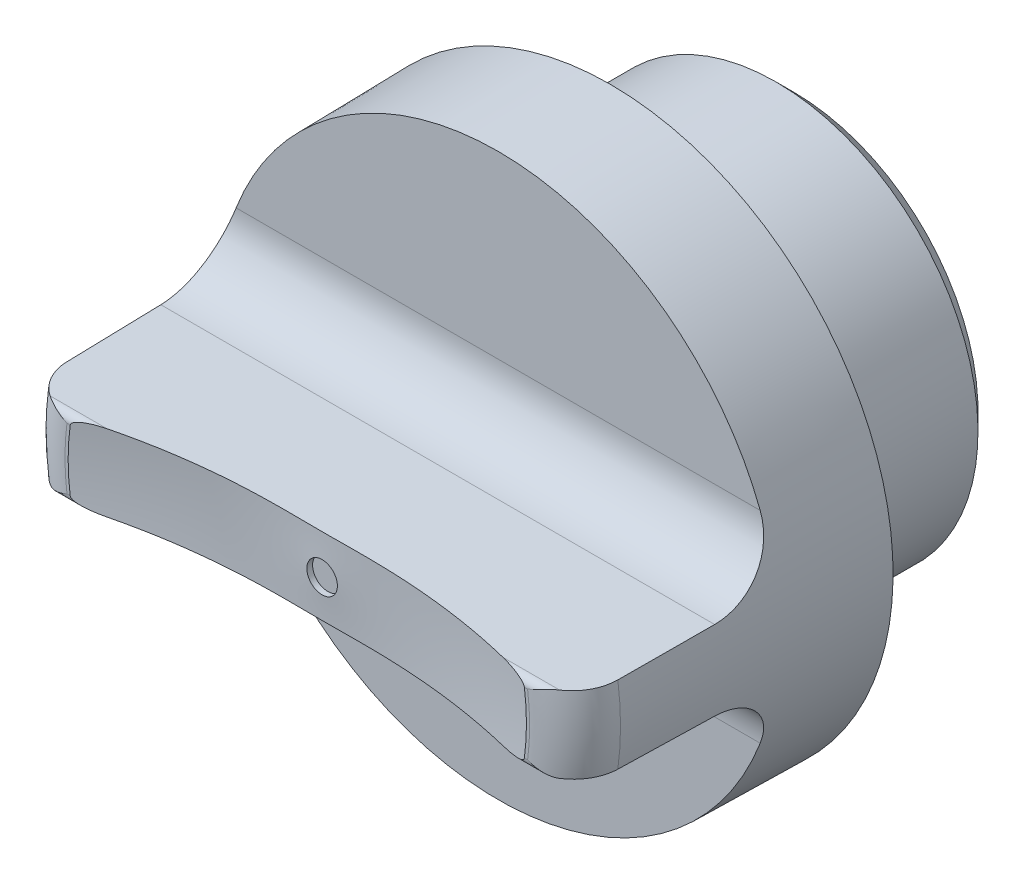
ISO-10303-21;
HEADER;
FILE_DESCRIPTION(('STEP AP214'),'2;1');
FILE_NAME('part.step','',(''),(''),'','','');
FILE_SCHEMA(('AUTOMOTIVE_DESIGN { 1 0 10303 214 1 1 1 1 }'));
ENDSEC;
DATA;
#1=APPLICATION_CONTEXT('core data for automotive mechanical design processes');
#2=APPLICATION_PROTOCOL_DEFINITION('international standard','automotive_design',2000,#1);
#3=PRODUCT_CONTEXT('',#1,'mechanical');
#4=PRODUCT('Part','Part','',(#3));
#5=PRODUCT_RELATED_PRODUCT_CATEGORY('part','',(#4));
#6=PRODUCT_DEFINITION_FORMATION('','',#4);
#7=PRODUCT_DEFINITION_CONTEXT('part definition',#1,'design');
#8=PRODUCT_DEFINITION('design','',#6,#7);
#9=PRODUCT_DEFINITION_SHAPE('','',#8);
#10=(LENGTH_UNIT() NAMED_UNIT(*) SI_UNIT(.MILLI.,.METRE.));
#11=(NAMED_UNIT(*) PLANE_ANGLE_UNIT() SI_UNIT($,.RADIAN.));
#12=(NAMED_UNIT(*) SI_UNIT($,.STERADIAN.) SOLID_ANGLE_UNIT());
#13=UNCERTAINTY_MEASURE_WITH_UNIT(LENGTH_MEASURE(1.E-05),#10,'distance_accuracy_value','');
#14=(GEOMETRIC_REPRESENTATION_CONTEXT(3) GLOBAL_UNCERTAINTY_ASSIGNED_CONTEXT((#13)) GLOBAL_UNIT_ASSIGNED_CONTEXT((#10,
#11,#12)) REPRESENTATION_CONTEXT('',''));
#15=CARTESIAN_POINT('',(0.,0.,0.));
#16=DIRECTION('',(0.,0.,1.));
#17=DIRECTION('',(1.,0.,0.));
#18=AXIS2_PLACEMENT_3D('',#15,#16,#17);
#19=CARTESIAN_POINT('',(15.,0.,20.5));
#20=DIRECTION('',(0.,0.,-1.));
#21=DIRECTION('',(0.,1.,0.));
#22=AXIS2_PLACEMENT_3D('',#19,#20,#21);
#23=PLANE('',#22);
#24=CARTESIAN_POINT('',(0.,0.,20.5));
#25=DIRECTION('',(0.,0.,-1.));
#26=DIRECTION('',(0.,1.,0.));
#27=AXIS2_PLACEMENT_3D('',#24,#25,#26);
#28=CIRCLE('',#27,15.2093999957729);
#29=CARTESIAN_POINT('',(-15.0766256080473,-2.00529511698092,20.5));
#30=VERTEX_POINT('',#29);
#31=CARTESIAN_POINT('',(-15.0766256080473,2.00529511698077,20.5));
#32=VERTEX_POINT('',#31);
#33=EDGE_CURVE('E328',#30,#32,#28,.T.);
#34=ORIENTED_EDGE('',*,*,#33,.F.);
#35=DIRECTION('',(-1.,0.,0.));
#36=VECTOR('',#35,1.);
#37=CARTESIAN_POINT('',(37.,-2.00529511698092,20.5));
#38=LINE('',#37,#36);
#39=CARTESIAN_POINT('',(-14.8653554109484,-2.00529511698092,20.5));
#40=VERTEX_POINT('',#39);
#41=EDGE_CURVE('E345',#40,#30,#38,.T.);
#42=ORIENTED_EDGE('',*,*,#41,.F.);
#43=CARTESIAN_POINT('',(0.,0.,20.5));
#44=DIRECTION('',(0.,0.,-1.));
#45=DIRECTION('',(0.,1.,0.));
#46=AXIS2_PLACEMENT_3D('',#43,#44,#45);
#47=CIRCLE('',#46,15.);
#48=CARTESIAN_POINT('',(-14.8653554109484,2.00529511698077,20.5));
#49=VERTEX_POINT('',#48);
#50=EDGE_CURVE('E332',#40,#49,#47,.T.);
#51=ORIENTED_EDGE('',*,*,#50,.T.);
#52=DIRECTION('',(-1.,0.,0.));
#53=VECTOR('',#52,1.);
#54=CARTESIAN_POINT('',(37.,2.00529511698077,20.5));
#55=LINE('',#54,#53);
#56=EDGE_CURVE('E343',#49,#32,#55,.T.);
#57=ORIENTED_EDGE('',*,*,#56,.T.);
#58=EDGE_LOOP('',(#34,#42,#51,#57));
#59=FACE_BOUND('',#58,.T.);
#60=ADVANCED_FACE('F14',(#59),#23,.F.);
#61=CARTESIAN_POINT('',(15.0766256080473,2.00529511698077,20.5));
#62=VERTEX_POINT('',#61);
#63=CARTESIAN_POINT('',(14.8653554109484,2.00529511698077,20.5));
#64=VERTEX_POINT('',#63);
#65=EDGE_CURVE('E437',#62,#64,#55,.T.);
#66=ORIENTED_EDGE('',*,*,#65,.T.);
#67=CARTESIAN_POINT('',(14.8653554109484,-2.00529511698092,20.5));
#68=VERTEX_POINT('',#67);
#69=EDGE_CURVE('E120',#64,#68,#47,.T.);
#70=ORIENTED_EDGE('',*,*,#69,.T.);
#71=CARTESIAN_POINT('',(15.0766256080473,-2.00529511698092,20.5));
#72=VERTEX_POINT('',#71);
#73=EDGE_CURVE('E387',#72,#68,#38,.T.);
#74=ORIENTED_EDGE('',*,*,#73,.F.);
#75=EDGE_CURVE('E329',#62,#72,#28,.T.);
#76=ORIENTED_EDGE('',*,*,#75,.F.);
#77=EDGE_LOOP('',(#66,#70,#74,#76));
#78=FACE_BOUND('',#77,.T.);
#79=ADVANCED_FACE('F438',(#78),#23,.F.);
#80=CARTESIAN_POINT('',(0.,0.,17.5));
#81=DIRECTION('',(0.,0.,-1.));
#82=DIRECTION('',(0.,1.,0.));
#83=AXIS2_PLACEMENT_3D('',#80,#81,#82);
#84=TOROIDAL_SURFACE('',#83,15.2093999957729,3.);
#85=CARTESIAN_POINT('',(0.,0.,17.5497396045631));
#86=DIRECTION('',(0.,0.,-1.));
#87=DIRECTION('',(0.,1.,0.));
#88=AXIS2_PLACEMENT_3D('',#85,#86,#87);
#89=CIRCLE('',#88,18.2089876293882);
#90=CARTESIAN_POINT('',(-18.0321709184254,-2.53141115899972,17.5497396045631));
#91=VERTEX_POINT('',#90);
#92=CARTESIAN_POINT('',(-18.0321709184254,2.5314111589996,17.5497396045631));
#93=VERTEX_POINT('',#92);
#94=EDGE_CURVE('E324',#91,#93,#89,.T.);
#95=ORIENTED_EDGE('',*,*,#94,.F.);
#96=CARTESIAN_POINT('',(-18.0315005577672,-2.53272050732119,17.4267604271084));
#97=CARTESIAN_POINT('',(-18.0336967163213,-2.5318300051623,17.5103999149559));
#98=CARTESIAN_POINT('',(-18.032342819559,-2.53093855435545,17.5941285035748));
#99=CARTESIAN_POINT('',(-18.022581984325,-2.52916008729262,17.7611691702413));
#100=CARTESIAN_POINT('',(-18.0141754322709,-2.52827307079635,17.8444812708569));
#101=CARTESIAN_POINT('',(-17.9903704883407,-2.52651073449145,18.0100068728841));
#102=CARTESIAN_POINT('',(-17.9749802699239,-2.52563540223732,18.0922215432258));
#103=CARTESIAN_POINT('',(-17.9373401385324,-2.52390187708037,18.2550410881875));
#104=CARTESIAN_POINT('',(-17.9150903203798,-2.52304368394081,18.3356459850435));
#105=CARTESIAN_POINT('',(-17.838243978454,-2.52050331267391,18.574247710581));
#106=CARTESIAN_POINT('',(-17.7735374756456,-2.51885438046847,18.7291219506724));
#107=CARTESIAN_POINT('',(-17.6191138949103,-2.51569558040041,19.0258089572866));
#108=CARTESIAN_POINT('',(-17.5293897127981,-2.51418575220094,19.167617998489));
#109=CARTESIAN_POINT('',(-17.3272248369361,-2.51134178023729,19.4347351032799));
#110=CARTESIAN_POINT('',(-17.2147086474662,-2.51000824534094,19.5599859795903));
#111=CARTESIAN_POINT('',(-16.9704641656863,-2.50756064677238,19.7898741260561));
#112=CARTESIAN_POINT('',(-16.8387644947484,-2.50644626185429,19.8945415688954));
#113=CARTESIAN_POINT('',(-16.6617274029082,-2.50518808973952,20.0127140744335));
#114=CARTESIAN_POINT('',(-16.6233755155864,-2.50492867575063,20.0370792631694));
#115=CARTESIAN_POINT('',(-16.5456782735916,-2.5044288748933,20.0840225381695));
#116=CARTESIAN_POINT('',(-16.506334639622,-2.50418845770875,20.1066034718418));
#117=CARTESIAN_POINT('',(-16.4664914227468,-2.50395743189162,20.1283023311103));
#118=B_SPLINE_CURVE_WITH_KNOTS('',3,(#96,#97,#98,#99,#100,#101,#102,#103,#104,#105,#106,#107,
#108,#109,#110,#111,#112,#113,#114,#115,#116,#117),.UNSPECIFIED.,.F.,.F.,(4,2,2,2,2,2,2,2,2,2,
4),(0.,0.250937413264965,0.50186107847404,0.752491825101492,1.00311910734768,1.50410315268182,
2.00522960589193,2.50804395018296,3.01011564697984,3.14640049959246,3.28246327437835),.UNSPECIFIED.);
#119=CARTESIAN_POINT('',(-16.6724848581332,-2.5052667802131,20.0053231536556));
#120=VERTEX_POINT('',#119);
#121=EDGE_CURVE('E222',#91,#120,#118,.T.);
#122=ORIENTED_EDGE('',*,*,#121,.T.);
#123=CARTESIAN_POINT('',(-15.0766256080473,-2.00529511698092,20.5000000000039));
#124=CARTESIAN_POINT('',(-15.0800081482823,-2.00674183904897,20.4999999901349));
#125=CARTESIAN_POINT('',(-15.0833907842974,-2.00818865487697,20.4999937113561));
#126=CARTESIAN_POINT('',(-15.2426464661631,-2.07630595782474,20.4994028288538));
#127=CARTESIAN_POINT('',(-15.3987038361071,-2.14308728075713,20.4855071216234));
#128=CARTESIAN_POINT('',(-15.7093995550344,-2.26872768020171,20.4304725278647));
#129=CARTESIAN_POINT('',(-15.8640382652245,-2.3275888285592,20.3893407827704));
#130=CARTESIAN_POINT('',(-16.0727436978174,-2.39506389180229,20.3143393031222));
#131=CARTESIAN_POINT('',(-16.1285267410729,-2.41190344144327,20.2923460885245));
#132=CARTESIAN_POINT('',(-16.2393967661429,-2.44223847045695,20.2447019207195));
#133=CARTESIAN_POINT('',(-16.2944843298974,-2.45573694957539,20.2190542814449));
#134=CARTESIAN_POINT('',(-16.4041382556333,-2.47857605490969,20.1640074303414));
#135=CARTESIAN_POINT('',(-16.4586989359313,-2.48788920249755,20.1345850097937));
#136=CARTESIAN_POINT('',(-16.5396655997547,-2.49776473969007,20.0879056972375));
#137=CARTESIAN_POINT('',(-16.5665489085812,-2.50037505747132,20.0718953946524));
#138=CARTESIAN_POINT('',(-16.6199567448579,-2.50403774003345,20.0390852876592));
#139=CARTESIAN_POINT('',(-16.6464810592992,-2.50508921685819,20.0222850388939));
#140=CARTESIAN_POINT('',(-16.6727915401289,-2.50526886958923,20.0051231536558));
#141=B_SPLINE_CURVE_WITH_KNOTS('',3,(#123,#124,#125,#126,#127,#128,#129,#130,#131,#132,#133,
#134,#135,#136,#137,#138,#139,#140),.UNSPECIFIED.,.F.,.F.,(4,2,2,2,2,2,2,2,4),(0.,
0.0110371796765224,0.519620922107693,1.02807136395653,1.21475966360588,1.40127973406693,
1.58900711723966,1.68315712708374,1.77736074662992),.UNSPECIFIED.);
#142=EDGE_CURVE('E23',#30,#120,#141,.T.);
#143=ORIENTED_EDGE('',*,*,#142,.F.);
#144=ORIENTED_EDGE('',*,*,#33,.T.);
#145=CARTESIAN_POINT('',(-16.6727915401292,2.50526886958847,20.0051231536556));
#146=CARTESIAN_POINT('',(-16.6285793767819,2.50494358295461,20.0339745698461));
#147=CARTESIAN_POINT('',(-16.5837762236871,2.50219569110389,20.0617758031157));
#148=CARTESIAN_POINT('',(-16.4933215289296,2.49264395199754,20.1150095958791));
#149=CARTESIAN_POINT('',(-16.44767194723,2.48584855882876,20.1404469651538));
#150=CARTESIAN_POINT('',(-16.3559308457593,2.46903068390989,20.1886704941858));
#151=CARTESIAN_POINT('',(-16.3098432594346,2.45902658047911,20.2114707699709));
#152=CARTESIAN_POINT('',(-16.2171079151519,2.43635639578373,20.2545139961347));
#153=CARTESIAN_POINT('',(-16.1704597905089,2.4236884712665,20.2747551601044));
#154=CARTESIAN_POINT('',(-15.9849902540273,2.36933093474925,20.3496767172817));
#155=CARTESIAN_POINT('',(-15.84440464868,2.31935385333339,20.3942520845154));
#156=CARTESIAN_POINT('',(-15.5614776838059,2.21021378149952,20.4605358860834));
#157=CARTESIAN_POINT('',(-15.4191338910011,2.15103633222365,20.4822079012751));
#158=CARTESIAN_POINT('',(-15.2133613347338,2.06377986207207,20.4973118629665));
#159=CARTESIAN_POINT('',(-15.1500679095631,2.03670771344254,20.4997461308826));
#160=CARTESIAN_POINT('',(-15.0833908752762,2.00818870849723,20.49999372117));
#161=CARTESIAN_POINT('',(-15.0800082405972,2.00674189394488,20.5000000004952));
#162=CARTESIAN_POINT('',(-15.0766256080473,2.00529511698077,20.5000000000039));
#163=B_SPLINE_CURVE_WITH_KNOTS('',3,(#145,#146,#147,#148,#149,#150,#151,#152,#153,#154,#155,
#156,#157,#158,#159,#160,#161,#162),.UNSPECIFIED.,.F.,.F.,(4,2,2,2,2,2,2,2,4),(0.,
0.158220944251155,0.316112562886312,0.473115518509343,0.630227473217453,1.09474435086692,
1.55999876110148,1.76652188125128,1.77755906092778),.UNSPECIFIED.);
#164=CARTESIAN_POINT('',(-16.6724848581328,2.50526678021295,20.0053231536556));
#165=VERTEX_POINT('',#164);
#166=EDGE_CURVE('E237',#165,#32,#163,.T.);
#167=ORIENTED_EDGE('',*,*,#166,.F.);
#168=CARTESIAN_POINT('',(-16.4664914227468,2.50395743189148,20.1283023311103));
#169=CARTESIAN_POINT('',(-16.5408113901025,2.50438821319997,20.0878416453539));
#170=CARTESIAN_POINT('',(-16.6134291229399,2.50485223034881,20.0442593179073));
#171=CARTESIAN_POINT('',(-16.7547619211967,2.50584335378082,19.9511690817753));
#172=CARTESIAN_POINT('',(-16.8234769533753,2.50637046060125,19.9016611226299));
#173=CARTESIAN_POINT('',(-16.9564610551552,2.50748400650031,19.7970724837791));
#174=CARTESIAN_POINT('',(-17.0207330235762,2.50807040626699,19.7419954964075));
#175=CARTESIAN_POINT('',(-17.1443965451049,2.50929851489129,19.6266466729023));
#176=CARTESIAN_POINT('',(-17.2037882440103,2.50994022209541,19.5663749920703));
#177=CARTESIAN_POINT('',(-17.3740518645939,2.51194290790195,19.3782748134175));
#178=CARTESIAN_POINT('',(-17.4770439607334,2.51338171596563,19.2431362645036));
#179=CARTESIAN_POINT('',(-17.6586442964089,2.51642371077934,18.9574200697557));
#180=CARTESIAN_POINT('',(-17.7372487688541,2.51802692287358,18.8068400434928));
#181=CARTESIAN_POINT('',(-17.8673739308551,2.52134157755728,18.4955145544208));
#182=CARTESIAN_POINT('',(-17.9190600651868,2.52305228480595,18.3348381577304));
#183=CARTESIAN_POINT('',(-17.9944646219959,2.52654056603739,18.007204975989));
#184=CARTESIAN_POINT('',(-18.0182298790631,2.52831802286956,17.840259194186));
#185=CARTESIAN_POINT('',(-18.0300723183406,2.53053781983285,17.6317670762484));
#186=CARTESIAN_POINT('',(-18.0315471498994,2.53097460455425,17.5907425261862));
#187=CARTESIAN_POINT('',(-18.0327947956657,2.53184778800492,17.508729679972));
#188=CARTESIAN_POINT('',(-18.0325701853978,2.53228418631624,17.4677414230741));
#189=CARTESIAN_POINT('',(-18.0315005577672,2.53272050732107,17.4267604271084));
#190=B_SPLINE_CURVE_WITH_KNOTS('',3,(#168,#169,#170,#171,#172,#173,#174,#175,#176,#177,#178,
#179,#180,#181,#182,#183,#184,#185,#186,#187,#188,#189),.UNSPECIFIED.,.F.,.F.,(4,2,2,2,2,2,2,2,
2,2,4),(0.,0.253784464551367,0.507571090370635,0.761190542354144,1.01480241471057,
1.52190684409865,2.02908956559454,2.5331171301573,3.03629802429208,3.1594379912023,
3.28239137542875),.UNSPECIFIED.);
#191=EDGE_CURVE('E183',#165,#93,#190,.T.);
#192=ORIENTED_EDGE('',*,*,#191,.T.);
#193=EDGE_LOOP('',(#95,#122,#143,#144,#167,#192));
#194=FACE_BOUND('',#193,.T.);
#195=ADVANCED_FACE('F207',(#194),#84,.T.);
#196=CARTESIAN_POINT('',(0.,0.,17.5497396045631));
#197=DIRECTION('',(0.,0.,-1.));
#198=DIRECTION('',(0.,1.,0.));
#199=AXIS2_PLACEMENT_3D('',#196,#197,#198);
#200=CONICAL_SURFACE('',#199,18.2089876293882,0.016580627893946);
#201=CARTESIAN_POINT('',(0.,0.,0.));
#202=DIRECTION('',(0.,0.,-1.));
#203=DIRECTION('',(0.,1.,0.));
#204=AXIS2_PLACEMENT_3D('',#201,#202,#203);
#205=CIRCLE('',#204,18.5);
#206=CARTESIAN_POINT('',(0.,18.5,0.));
#207=VERTEX_POINT('',#206);
#208=EDGE_CURVE('E321',#207,#207,#205,.T.);
#209=ORIENTED_EDGE('',*,*,#208,.F.);
#210=EDGE_LOOP('',(#209));
#211=FACE_BOUND('',#210,.T.);
#212=CARTESIAN_POINT('',(-18.0321678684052,-2.53140902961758,17.5499396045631));
#213=CARTESIAN_POINT('',(-18.0480348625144,-2.54248664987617,16.5094856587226));
#214=CARTESIAN_POINT('',(-18.0638955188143,-2.55356427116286,15.4690316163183));
#215=CARTESIAN_POINT('',(-18.0956041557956,-2.57571951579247,13.3881233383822));
#216=CARTESIAN_POINT('',(-18.1114521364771,-2.58679713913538,12.3476691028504));
#217=CARTESIAN_POINT('',(-18.1272937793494,-2.59787476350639,11.3072147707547));
#218=B_SPLINE_CURVE_WITH_KNOTS('',3,(#212,#213,#214,#215,#216,#217),.UNSPECIFIED.,.F.,.F.,(4,2,
4),(0.,3.12190166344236,6.24380332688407),.UNSPECIFIED.);
#219=CARTESIAN_POINT('',(-18.1272907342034,-2.59787263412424,11.3074147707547));
#220=VERTEX_POINT('',#219);
#221=EDGE_CURVE('E401',#91,#220,#218,.T.);
#222=ORIENTED_EDGE('',*,*,#221,.F.);
#223=ORIENTED_EDGE('',*,*,#94,.T.);
#224=CARTESIAN_POINT('',(-18.1272937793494,2.59787476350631,11.3072147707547));
#225=CARTESIAN_POINT('',(-18.1114521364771,2.58679713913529,12.3476691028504));
#226=CARTESIAN_POINT('',(-18.0956041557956,2.57571951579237,13.3881233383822));
#227=CARTESIAN_POINT('',(-18.0638955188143,2.55356427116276,15.4690316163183));
#228=CARTESIAN_POINT('',(-18.0480348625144,2.54248664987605,16.5094856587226));
#229=CARTESIAN_POINT('',(-18.0321678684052,2.53140902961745,17.5499396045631));
#230=B_SPLINE_CURVE_WITH_KNOTS('',3,(#224,#225,#226,#227,#228,#229),.UNSPECIFIED.,.F.,.F.,(4,2,
4),(0.,3.1219016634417,6.24380332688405),.UNSPECIFIED.);
#231=CARTESIAN_POINT('',(-18.1272907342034,2.59787263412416,11.3074147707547));
#232=VERTEX_POINT('',#231);
#233=EDGE_CURVE('E134',#232,#93,#230,.T.);
#234=ORIENTED_EDGE('',*,*,#233,.F.);
#235=CARTESIAN_POINT('',(-17.1529521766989,6.59784593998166,7.35000000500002));
#236=CARTESIAN_POINT('',(-17.1951814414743,6.48808902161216,7.34998383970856));
#237=CARTESIAN_POINT('',(-17.2362737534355,6.37787673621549,7.3545064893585));
#238=CARTESIAN_POINT('',(-17.3159755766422,6.15728049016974,7.37277614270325));
#239=CARTESIAN_POINT('',(-17.3545842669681,6.04689648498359,7.38652617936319));
#240=CARTESIAN_POINT('',(-17.4291310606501,5.826623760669,7.42342187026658));
#241=CARTESIAN_POINT('',(-17.4650655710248,5.71673588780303,7.44657990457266));
#242=CARTESIAN_POINT('',(-17.5340366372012,5.49846753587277,7.50233954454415));
#243=CARTESIAN_POINT('',(-17.5670735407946,5.39008687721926,7.53494001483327));
#244=CARTESIAN_POINT('',(-17.6302088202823,5.17546051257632,7.60963518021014));
#245=CARTESIAN_POINT('',(-17.6603002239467,5.06922032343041,7.65175165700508));
#246=CARTESIAN_POINT('',(-17.7174050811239,4.86001640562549,7.74531169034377));
#247=CARTESIAN_POINT('',(-17.7444173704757,4.75705392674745,7.79675875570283));
#248=CARTESIAN_POINT('',(-17.7953066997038,4.55552247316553,7.90863471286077));
#249=CARTESIAN_POINT('',(-17.8191882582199,4.45694730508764,7.96905038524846));
#250=CARTESIAN_POINT('',(-17.8639181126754,4.26490203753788,8.09858111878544));
#251=CARTESIAN_POINT('',(-17.8847653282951,4.17143376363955,8.16769926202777));
#252=CARTESIAN_POINT('',(-17.9226484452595,3.99454962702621,8.31087943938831));
#253=CARTESIAN_POINT('',(-17.9398128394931,3.91087137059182,8.38458362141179));
#254=CARTESIAN_POINT('',(-17.9715779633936,3.74968761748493,8.53902201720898));
#255=CARTESIAN_POINT('',(-17.9861777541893,3.67218438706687,8.61975878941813));
#256=CARTESIAN_POINT('',(-18.0129522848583,3.5240406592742,8.78768066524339));
#257=CARTESIAN_POINT('',(-18.0251270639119,3.4534000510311,8.87486566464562));
#258=CARTESIAN_POINT('',(-18.047216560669,3.31956056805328,9.05505454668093));
#259=CARTESIAN_POINT('',(-18.0571304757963,3.25636433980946,9.14806048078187));
#260=CARTESIAN_POINT('',(-18.0833782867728,3.08113775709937,9.43098646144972));
#261=CARTESIAN_POINT('',(-18.0967554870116,2.98037181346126,9.62833840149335));
#262=CARTESIAN_POINT('',(-18.1167014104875,2.81280046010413,10.0370899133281));
#263=CARTESIAN_POINT('',(-18.1232746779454,2.74597239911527,10.2484800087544));
#264=CARTESIAN_POINT('',(-18.1293032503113,2.6655795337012,10.6023087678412));
#265=CARTESIAN_POINT('',(-18.1304620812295,2.64151652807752,10.7424158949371));
#266=CARTESIAN_POINT('',(-18.130524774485,2.60841442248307,11.0241819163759));
#267=CARTESIAN_POINT('',(-18.1294320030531,2.59935293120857,11.1658381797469));
#268=CARTESIAN_POINT('',(-18.1272876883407,2.59787050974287,11.3076147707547));
#269=B_SPLINE_CURVE_WITH_KNOTS('',3,(#235,#236,#237,#238,#239,#240,#241,#242,#243,#244,#245,
#246,#247,#248,#249,#250,#251,#252,#253,#254,#255,#256,#257,#258,#259,#260,#261,#262,#263,#264,
#265,#266,#267,#268),.UNSPECIFIED.,.F.,.F.,(4,2,2,2,2,2,2,2,2,2,2,2,2,2,2,2,4),(0.,
0.352732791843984,0.705581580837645,1.05889619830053,1.41216835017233,1.76625746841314,
2.1204800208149,2.4741855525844,2.8280167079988,3.16607121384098,3.50424922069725,
3.84242176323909,4.18071416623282,4.84331662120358,5.50547625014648,5.93119852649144,
6.35628479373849),.UNSPECIFIED.);
#270=CARTESIAN_POINT('',(-17.1530291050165,6.59764593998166,7.35));
#271=VERTEX_POINT('',#270);
#272=EDGE_CURVE('E125',#271,#232,#269,.T.);
#273=ORIENTED_EDGE('',*,*,#272,.F.);
#274=CARTESIAN_POINT('',(0.,0.,7.35));
#275=DIRECTION('',(0.,0.,1.));
#276=DIRECTION('',(0.,-1.,0.));
#277=AXIS2_PLACEMENT_3D('',#274,#275,#276);
#278=CIRCLE('',#277,18.3781212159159);
#279=CARTESIAN_POINT('',(17.1530291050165,6.59764593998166,7.35));
#280=VERTEX_POINT('',#279);
#281=EDGE_CURVE('E114',#280,#271,#278,.T.);
#282=ORIENTED_EDGE('',*,*,#281,.F.);
#283=CARTESIAN_POINT('',(18.1272876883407,2.59787050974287,11.3076147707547));
#284=CARTESIAN_POINT('',(18.128972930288,2.59903443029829,11.1966003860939));
#285=CARTESIAN_POINT('',(18.1300065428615,2.6048447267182,11.0856262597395));
#286=CARTESIAN_POINT('',(18.1307113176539,2.62566508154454,10.86454272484));
#287=CARTESIAN_POINT('',(18.13038251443,2.64067490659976,10.7544332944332));
#288=CARTESIAN_POINT('',(18.1283039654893,2.67978995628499,10.5359215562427));
#289=CARTESIAN_POINT('',(18.1265550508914,2.70388985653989,10.4275182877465));
#290=CARTESIAN_POINT('',(18.121539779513,2.76100450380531,10.2131239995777));
#291=CARTESIAN_POINT('',(18.1182734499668,2.79401909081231,10.1071329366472));
#292=CARTESIAN_POINT('',(18.1101003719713,2.86873366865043,9.89826980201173));
#293=CARTESIAN_POINT('',(18.1051929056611,2.91043745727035,9.79539911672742));
#294=CARTESIAN_POINT('',(18.0935931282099,3.00222026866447,9.59352254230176));
#295=CARTESIAN_POINT('',(18.086900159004,3.05230237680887,9.49451809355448));
#296=CARTESIAN_POINT('',(18.0715781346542,3.16040895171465,9.30118058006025));
#297=CARTESIAN_POINT('',(18.0629502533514,3.21842859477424,9.20684472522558));
#298=CARTESIAN_POINT('',(18.0435896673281,3.34199727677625,9.02341780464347));
#299=CARTESIAN_POINT('',(18.0328561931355,3.40754906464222,8.93432867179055));
#300=CARTESIAN_POINT('',(18.0091726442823,3.54536281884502,8.76240317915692));
#301=CARTESIAN_POINT('',(17.9962315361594,3.61759712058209,8.6795434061));
#302=CARTESIAN_POINT('',(17.9679500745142,3.76843770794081,8.52022637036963));
#303=CARTESIAN_POINT('',(17.9526088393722,3.8470463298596,8.44377147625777));
#304=CARTESIAN_POINT('',(17.9194089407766,4.00993359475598,8.29783734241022));
#305=CARTESIAN_POINT('',(17.9015513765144,4.09420975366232,8.22835507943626));
#306=CARTESIAN_POINT('',(17.8632057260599,4.26780258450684,8.09674030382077));
#307=CARTESIAN_POINT('',(17.8427166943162,4.35712106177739,8.03461044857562));
#308=CARTESIAN_POINT('',(17.7990324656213,4.54009861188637,7.91805116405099));
#309=CARTESIAN_POINT('',(17.7758355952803,4.63376034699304,7.86362654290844));
#310=CARTESIAN_POINT('',(17.7267094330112,4.82465429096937,7.76277829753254));
#311=CARTESIAN_POINT('',(17.7007790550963,4.92188790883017,7.7163578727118));
#312=CARTESIAN_POINT('',(17.6462070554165,5.11912923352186,7.63173415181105));
#313=CARTESIAN_POINT('',(17.6175655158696,5.21913685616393,7.5935306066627));
#314=CARTESIAN_POINT('',(17.5576326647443,5.42116949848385,7.52543720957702));
#315=CARTESIAN_POINT('',(17.5263407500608,5.52319497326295,7.495549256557));
#316=CARTESIAN_POINT('',(17.4427548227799,5.78666553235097,7.42957441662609));
#317=CARTESIAN_POINT('',(17.3885899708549,5.94908955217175,7.39953798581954));
#318=CARTESIAN_POINT('',(17.3031834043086,6.19278726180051,7.36969917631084));
#319=CARTESIAN_POINT('',(17.2740458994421,6.27396619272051,7.36228874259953));
#320=CARTESIAN_POINT('',(17.2144624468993,6.43611628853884,7.35243907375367));
#321=CARTESIAN_POINT('',(17.1840169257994,6.51708751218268,7.34999823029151));
#322=CARTESIAN_POINT('',(17.1529521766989,6.59784593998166,7.35000000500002));
#323=B_SPLINE_CURVE_WITH_KNOTS('',3,(#283,#284,#285,#286,#287,#288,#289,#290,#291,#292,#293,
#294,#295,#296,#297,#298,#299,#300,#301,#302,#303,#304,#305,#306,#307,#308,#309,#310,#311,#312,
#313,#314,#315,#316,#317,#318,#319,#320,#321,#322),.UNSPECIFIED.,.F.,.F.,(4,2,2,2,2,2,2,2,2,2,2,
2,2,2,2,2,2,2,2,4),(0.,0.332999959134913,0.665991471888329,0.998788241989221,1.33157903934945,
1.66451559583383,1.99757502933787,2.3304329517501,2.66341274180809,2.99507096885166,
3.32685130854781,3.65848716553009,3.99024252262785,4.32220399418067,4.6542978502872,
4.98638163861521,5.31854119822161,5.83851385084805,6.09809187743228,6.3575858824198),.UNSPECIFIED.);
#324=CARTESIAN_POINT('',(18.1272907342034,2.59787263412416,11.3074147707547));
#325=VERTEX_POINT('',#324);
#326=EDGE_CURVE('E119',#325,#280,#323,.T.);
#327=ORIENTED_EDGE('',*,*,#326,.F.);
#328=CARTESIAN_POINT('',(18.0321678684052,2.53140902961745,17.5499396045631));
#329=CARTESIAN_POINT('',(18.0480348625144,2.54248664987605,16.5094856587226));
#330=CARTESIAN_POINT('',(18.0638955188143,2.55356427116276,15.4690316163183));
#331=CARTESIAN_POINT('',(18.0956041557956,2.57571951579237,13.3881233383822));
#332=CARTESIAN_POINT('',(18.1114521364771,2.58679713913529,12.3476691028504));
#333=CARTESIAN_POINT('',(18.1272937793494,2.59787476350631,11.3072147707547));
#334=B_SPLINE_CURVE_WITH_KNOTS('',3,(#328,#329,#330,#331,#332,#333),.UNSPECIFIED.,.F.,.F.,(4,2,
4),(0.,3.12190166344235,6.24380332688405),.UNSPECIFIED.);
#335=CARTESIAN_POINT('',(18.0321709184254,2.5314111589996,17.5497396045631));
#336=VERTEX_POINT('',#335);
#337=EDGE_CURVE('E136',#336,#325,#334,.T.);
#338=ORIENTED_EDGE('',*,*,#337,.F.);
#339=CARTESIAN_POINT('',(18.0321709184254,-2.53141115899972,17.5497396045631));
#340=VERTEX_POINT('',#339);
#341=EDGE_CURVE('E325',#336,#340,#89,.T.);
#342=ORIENTED_EDGE('',*,*,#341,.T.);
#343=CARTESIAN_POINT('',(18.1272937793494,-2.59787476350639,11.3072147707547));
#344=CARTESIAN_POINT('',(18.1114521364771,-2.58679713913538,12.3476691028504));
#345=CARTESIAN_POINT('',(18.0956041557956,-2.57571951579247,13.3881233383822));
#346=CARTESIAN_POINT('',(18.0638955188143,-2.55356427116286,15.4690316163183));
#347=CARTESIAN_POINT('',(18.0480348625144,-2.54248664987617,16.5094856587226));
#348=CARTESIAN_POINT('',(18.0321678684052,-2.53140902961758,17.5499396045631));
#349=B_SPLINE_CURVE_WITH_KNOTS('',3,(#343,#344,#345,#346,#347,#348),.UNSPECIFIED.,.F.,.F.,(4,2,
4),(0.,3.12190166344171,6.24380332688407),.UNSPECIFIED.);
#350=CARTESIAN_POINT('',(18.1272907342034,-2.59787263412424,11.3074147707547));
#351=VERTEX_POINT('',#350);
#352=EDGE_CURVE('E428',#351,#340,#349,.T.);
#353=ORIENTED_EDGE('',*,*,#352,.F.);
#354=CARTESIAN_POINT('',(17.1529521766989,-6.59784593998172,7.35000000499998));
#355=CARTESIAN_POINT('',(17.1951814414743,-6.48808902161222,7.34998383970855));
#356=CARTESIAN_POINT('',(17.2362737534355,-6.37787673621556,7.35450648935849));
#357=CARTESIAN_POINT('',(17.3159755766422,-6.15728049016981,7.37277614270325));
#358=CARTESIAN_POINT('',(17.3545842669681,-6.04689648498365,7.38652617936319));
#359=CARTESIAN_POINT('',(17.4291310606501,-5.82662376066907,7.42342187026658));
#360=CARTESIAN_POINT('',(17.4650655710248,-5.7167358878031,7.44657990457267));
#361=CARTESIAN_POINT('',(17.5340366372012,-5.49846753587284,7.50233954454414));
#362=CARTESIAN_POINT('',(17.5670735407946,-5.39008687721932,7.53494001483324));
#363=CARTESIAN_POINT('',(17.6302088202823,-5.1754605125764,7.6096351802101));
#364=CARTESIAN_POINT('',(17.6603002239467,-5.06922032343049,7.65175165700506));
#365=CARTESIAN_POINT('',(17.7174050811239,-4.86001640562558,7.74531169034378));
#366=CARTESIAN_POINT('',(17.7444173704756,-4.75705392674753,7.79675875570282));
#367=CARTESIAN_POINT('',(17.7953066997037,-4.5555224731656,7.90863471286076));
#368=CARTESIAN_POINT('',(17.8191882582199,-4.45694730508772,7.96905038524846));
#369=CARTESIAN_POINT('',(17.8639181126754,-4.26490203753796,8.09858111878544));
#370=CARTESIAN_POINT('',(17.8847653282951,-4.17143376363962,8.16769926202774));
#371=CARTESIAN_POINT('',(17.9226484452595,-3.99454962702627,8.31087943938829));
#372=CARTESIAN_POINT('',(17.9398128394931,-3.91087137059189,8.38458362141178));
#373=CARTESIAN_POINT('',(17.9715779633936,-3.74968761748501,8.53902201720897));
#374=CARTESIAN_POINT('',(17.9861777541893,-3.67218438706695,8.61975878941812));
#375=CARTESIAN_POINT('',(18.0129522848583,-3.52404065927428,8.78768066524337));
#376=CARTESIAN_POINT('',(18.0251270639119,-3.45340005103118,8.87486566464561));
#377=CARTESIAN_POINT('',(18.047216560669,-3.31956056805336,9.05505454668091));
#378=CARTESIAN_POINT('',(18.0571304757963,-3.25636433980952,9.14806048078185));
#379=CARTESIAN_POINT('',(18.0833782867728,-3.08113775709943,9.43098646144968));
#380=CARTESIAN_POINT('',(18.0967554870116,-2.98037181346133,9.62833840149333));
#381=CARTESIAN_POINT('',(18.1167014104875,-2.81280046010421,10.0370899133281));
#382=CARTESIAN_POINT('',(18.1232746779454,-2.74597239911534,10.2484800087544));
#383=CARTESIAN_POINT('',(18.1293032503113,-2.66557953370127,10.6023087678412));
#384=CARTESIAN_POINT('',(18.1304620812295,-2.64151652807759,10.7424158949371));
#385=CARTESIAN_POINT('',(18.130524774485,-2.60841442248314,11.0241819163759));
#386=CARTESIAN_POINT('',(18.1294320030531,-2.59935293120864,11.1658381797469));
#387=CARTESIAN_POINT('',(18.1272876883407,-2.59787050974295,11.3076147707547));
#388=B_SPLINE_CURVE_WITH_KNOTS('',3,(#354,#355,#356,#357,#358,#359,#360,#361,#362,#363,#364,
#365,#366,#367,#368,#369,#370,#371,#372,#373,#374,#375,#376,#377,#378,#379,#380,#381,#382,#383,
#384,#385,#386,#387),.UNSPECIFIED.,.F.,.F.,(4,2,2,2,2,2,2,2,2,2,2,2,2,2,2,2,4),(0.,
0.352732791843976,0.705581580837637,1.05889619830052,1.41216835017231,1.76625746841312,
2.12048002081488,2.47418555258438,2.82801670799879,3.16607121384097,3.50424922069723,
3.84242176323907,4.18071416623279,4.84331662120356,5.50547625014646,5.93119852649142,
6.35628479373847),.UNSPECIFIED.);
#389=CARTESIAN_POINT('',(17.1530291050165,-6.59764593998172,7.35));
#390=VERTEX_POINT('',#389);
#391=EDGE_CURVE('E423',#390,#351,#388,.T.);
#392=ORIENTED_EDGE('',*,*,#391,.F.);
#393=CARTESIAN_POINT('',(0.,0.,7.35));
#394=DIRECTION('',(0.,0.,1.));
#395=DIRECTION('',(0.,-1.,0.));
#396=AXIS2_PLACEMENT_3D('',#393,#394,#395);
#397=CIRCLE('',#396,18.3781212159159);
#398=CARTESIAN_POINT('',(-17.1530291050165,-6.59764593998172,7.35));
#399=VERTEX_POINT('',#398);
#400=EDGE_CURVE('E403',#399,#390,#397,.T.);
#401=ORIENTED_EDGE('',*,*,#400,.F.);
#402=CARTESIAN_POINT('',(-18.1272876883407,-2.59787050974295,11.3076147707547));
#403=CARTESIAN_POINT('',(-18.128972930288,-2.59903443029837,11.1966003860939));
#404=CARTESIAN_POINT('',(-18.1300065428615,-2.60484472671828,11.0856262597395));
#405=CARTESIAN_POINT('',(-18.1307113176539,-2.62566508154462,10.86454272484));
#406=CARTESIAN_POINT('',(-18.13038251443,-2.64067490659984,10.7544332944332));
#407=CARTESIAN_POINT('',(-18.1283039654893,-2.67978995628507,10.5359215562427));
#408=CARTESIAN_POINT('',(-18.1265550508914,-2.70388985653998,10.4275182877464));
#409=CARTESIAN_POINT('',(-18.121539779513,-2.76100450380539,10.2131239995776));
#410=CARTESIAN_POINT('',(-18.1182734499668,-2.79401909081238,10.1071329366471));
#411=CARTESIAN_POINT('',(-18.1101003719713,-2.8687336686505,9.89826980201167));
#412=CARTESIAN_POINT('',(-18.1051929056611,-2.91043745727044,9.79539911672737));
#413=CARTESIAN_POINT('',(-18.0935931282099,-3.00222026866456,9.59352254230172));
#414=CARTESIAN_POINT('',(-18.086900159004,-3.05230237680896,9.49451809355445));
#415=CARTESIAN_POINT('',(-18.0715781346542,-3.16040895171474,9.30118058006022));
#416=CARTESIAN_POINT('',(-18.0629502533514,-3.21842859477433,9.20684472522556));
#417=CARTESIAN_POINT('',(-18.0435896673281,-3.34199727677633,9.02341780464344));
#418=CARTESIAN_POINT('',(-18.0328561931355,-3.40754906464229,8.93432867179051));
#419=CARTESIAN_POINT('',(-18.0091726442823,-3.54536281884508,8.7624031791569));
#420=CARTESIAN_POINT('',(-17.9962315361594,-3.61759712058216,8.67954340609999));
#421=CARTESIAN_POINT('',(-17.9679500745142,-3.76843770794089,8.52022637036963));
#422=CARTESIAN_POINT('',(-17.9526088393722,-3.84704632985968,8.44377147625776));
#423=CARTESIAN_POINT('',(-17.9194089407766,-4.00993359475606,8.29783734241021));
#424=CARTESIAN_POINT('',(-17.9015513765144,-4.09420975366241,8.22835507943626));
#425=CARTESIAN_POINT('',(-17.8632057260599,-4.26780258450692,8.09674030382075));
#426=CARTESIAN_POINT('',(-17.8427166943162,-4.35712106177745,8.03461044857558));
#427=CARTESIAN_POINT('',(-17.7990324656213,-4.54009861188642,7.91805116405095));
#428=CARTESIAN_POINT('',(-17.7758355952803,-4.63376034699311,7.86362654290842));
#429=CARTESIAN_POINT('',(-17.7267094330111,-4.82465429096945,7.76277829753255));
#430=CARTESIAN_POINT('',(-17.7007790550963,-4.92188790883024,7.7163578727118));
#431=CARTESIAN_POINT('',(-17.6462070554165,-5.11912923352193,7.63173415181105));
#432=CARTESIAN_POINT('',(-17.6175655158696,-5.219136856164,7.5935306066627));
#433=CARTESIAN_POINT('',(-17.5576326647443,-5.42116949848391,7.52543720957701));
#434=CARTESIAN_POINT('',(-17.5263407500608,-5.52319497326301,7.49554925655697));
#435=CARTESIAN_POINT('',(-17.4427548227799,-5.78666553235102,7.42957441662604));
#436=CARTESIAN_POINT('',(-17.3885899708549,-5.94908955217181,7.39953798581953));
#437=CARTESIAN_POINT('',(-17.3031834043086,-6.19278726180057,7.36969917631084));
#438=CARTESIAN_POINT('',(-17.2740458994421,-6.27396619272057,7.36228874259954));
#439=CARTESIAN_POINT('',(-17.2144624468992,-6.4361162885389,7.35243907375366));
#440=CARTESIAN_POINT('',(-17.1840169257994,-6.51708751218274,7.34999823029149));
#441=CARTESIAN_POINT('',(-17.1529521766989,-6.59784593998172,7.35000000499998));
#442=B_SPLINE_CURVE_WITH_KNOTS('',3,(#402,#403,#404,#405,#406,#407,#408,#409,#410,#411,#412,
#413,#414,#415,#416,#417,#418,#419,#420,#421,#422,#423,#424,#425,#426,#427,#428,#429,#430,#431,
#432,#433,#434,#435,#436,#437,#438,#439,#440,#441),.UNSPECIFIED.,.F.,.F.,(4,2,2,2,2,2,2,2,2,2,2,
2,2,2,2,2,2,2,2,4),(0.,0.332999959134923,0.66599147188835,0.998788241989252,1.33157903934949,
1.66451559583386,1.99757502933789,2.33043295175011,2.66341274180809,2.99507096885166,
3.32685130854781,3.65848716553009,3.99024252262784,4.32220399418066,4.65429785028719,
4.98638163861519,5.31854119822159,5.83851385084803,6.09809187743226,6.35758588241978),.UNSPECIFIED.);
#443=EDGE_CURVE('E402',#220,#399,#442,.T.);
#444=ORIENTED_EDGE('',*,*,#443,.F.);
#445=EDGE_LOOP('',(#222,#223,#234,#273,#282,#327,#338,#342,#353,#392,#401,#444));
#446=FACE_BOUND('',#445,.T.);
#447=ADVANCED_FACE('F132',(#211,#446),#200,.T.);
#448=CARTESIAN_POINT('',(0.,-2.05298675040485E-13,58.7998775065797));
#449=DIRECTION('',(0.,0.,-1.));
#450=DIRECTION('',(0.,1.,0.));
#451=AXIS2_PLACEMENT_3D('',#448,#449,#450);
#452=DEGENERATE_TOROIDAL_SURFACE('',#451,3.46226265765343,40.,.T.);
#453=ORIENTED_EDGE('',*,*,#69,.F.);
#454=CARTESIAN_POINT('',(14.8653822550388,2.00509511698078,20.49999996));
#455=CARTESIAN_POINT('',(14.863957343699,2.0159228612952,20.5000105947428));
#456=CARTESIAN_POINT('',(14.86133652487,2.02649464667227,20.4996574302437));
#457=CARTESIAN_POINT('',(14.8542623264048,2.04677607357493,20.4983762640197));
#458=CARTESIAN_POINT('',(14.8498417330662,2.05649754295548,20.4974584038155));
#459=CARTESIAN_POINT('',(14.8377525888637,2.07856841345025,20.4947708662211));
#460=CARTESIAN_POINT('',(14.8294874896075,2.09055636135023,20.4928115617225));
#461=CARTESIAN_POINT('',(14.8112928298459,2.11319468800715,20.4883555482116));
#462=CARTESIAN_POINT('',(14.8013494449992,2.12383255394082,20.4858543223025));
#463=CARTESIAN_POINT('',(14.7699851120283,2.15397086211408,20.4778417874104));
#464=CARTESIAN_POINT('',(14.7470245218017,2.17170408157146,20.4718203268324));
#465=CARTESIAN_POINT('',(14.6992321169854,2.20398623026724,20.4591479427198));
#466=CARTESIAN_POINT('',(14.674398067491,2.21853127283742,20.4524962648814));
#467=CARTESIAN_POINT('',(14.6054175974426,2.25505368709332,20.4339346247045));
#468=CARTESIAN_POINT('',(14.5602225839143,2.27485669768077,20.421682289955));
#469=CARTESIAN_POINT('',(14.4683284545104,2.3103429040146,20.3967454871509));
#470=CARTESIAN_POINT('',(14.421625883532,2.32601575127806,20.3840600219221));
#471=CARTESIAN_POINT('',(14.3269569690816,2.35447800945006,20.3583881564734));
#472=CARTESIAN_POINT('',(14.2789831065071,2.36724072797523,20.3454000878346));
#473=CARTESIAN_POINT('',(14.1825563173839,2.3903922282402,20.319375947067));
#474=CARTESIAN_POINT('',(14.1341040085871,2.40078373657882,20.3063399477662));
#475=CARTESIAN_POINT('',(13.991866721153,2.42840390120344,20.268226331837));
#476=CARTESIAN_POINT('',(13.8975824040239,2.44307229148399,20.24315770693));
#477=CARTESIAN_POINT('',(13.7082047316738,2.46724462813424,20.1932960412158));
#478=CARTESIAN_POINT('',(13.6131105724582,2.4767426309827,20.168503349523));
#479=CARTESIAN_POINT('',(13.426295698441,2.49122796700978,20.1203282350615));
#480=CARTESIAN_POINT('',(13.3345917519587,2.4963801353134,20.0969290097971));
#481=CARTESIAN_POINT('',(13.1511347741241,2.50326171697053,20.0506411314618));
#482=CARTESIAN_POINT('',(13.059382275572,2.50499849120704,20.0277514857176));
#483=CARTESIAN_POINT('',(12.9675802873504,2.50526886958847,20.0051231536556));
#484=B_SPLINE_CURVE_WITH_KNOTS('',3,(#454,#455,#456,#457,#458,#459,#460,#461,#462,#463,#464,
#465,#466,#467,#468,#469,#470,#471,#472,#473,#474,#475,#476,#477,#478,#479,#480,#481,#482,#483),
.UNSPECIFIED.,.F.,.F.,(4,2,2,2,2,2,2,2,2,2,2,2,2,2,4),(0.,0.0325480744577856,0.0645280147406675,
0.108360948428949,0.152574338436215,0.240972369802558,0.329477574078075,0.481611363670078,
0.634122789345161,0.787981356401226,0.941662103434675,1.23741554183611,1.53350824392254,
1.81778839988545,2.10145519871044),.UNSPECIFIED.);
#485=CARTESIAN_POINT('',(12.9683915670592,2.50526678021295,20.0053231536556));
#486=VERTEX_POINT('',#485);
#487=EDGE_CURVE('E273',#64,#486,#484,.T.);
#488=ORIENTED_EDGE('',*,*,#487,.T.);
#489=CARTESIAN_POINT('',(-13.2104588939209,2.50462293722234,20.0657954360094));
#490=CARTESIAN_POINT('',(-12.6695988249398,2.50608064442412,19.9288818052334));
#491=CARTESIAN_POINT('',(-12.1258948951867,2.50741845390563,19.8032294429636));
#492=CARTESIAN_POINT('',(-11.0337923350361,2.50985381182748,19.5744909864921));
#493=CARTESIAN_POINT('',(-10.4853939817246,2.51095137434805,19.4714035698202));
#494=CARTESIAN_POINT('',(-9.3890174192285,2.51289851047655,19.2885208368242));
#495=CARTESIAN_POINT('',(-8.84106774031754,2.51374990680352,19.2085543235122));
#496=CARTESIAN_POINT('',(-7.74240323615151,2.51521765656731,19.0706974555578));
#497=CARTESIAN_POINT('',(-7.19168839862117,2.51583400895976,19.0128071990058));
#498=CARTESIAN_POINT('',(-6.09240032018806,2.51683318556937,18.9189605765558));
#499=CARTESIAN_POINT('',(-5.54384033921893,2.51721766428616,18.8828488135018));
#500=CARTESIAN_POINT('',(-4.72034412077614,2.51763542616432,18.8436109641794));
#501=CARTESIAN_POINT('',(-4.44573808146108,2.51774818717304,18.8330200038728));
#502=CARTESIAN_POINT('',(-3.8963870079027,2.51792470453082,18.816440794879));
#503=CARTESIAN_POINT('',(-3.62164197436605,2.51798846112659,18.8104525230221));
#504=CARTESIAN_POINT('',(-3.07148881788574,2.51807341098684,18.8024736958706));
#505=CARTESIAN_POINT('',(-2.79608057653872,2.51809450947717,18.8004920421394));
#506=CARTESIAN_POINT('',(-2.24525716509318,2.51810489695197,18.7995164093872));
#507=CARTESIAN_POINT('',(-1.96984199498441,2.51809418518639,18.8005225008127));
#508=CARTESIAN_POINT('',(-1.41901572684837,2.51805934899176,18.8037944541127));
#509=CARTESIAN_POINT('',(-1.14360462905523,2.51803522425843,18.8060603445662));
#510=CARTESIAN_POINT('',(-0.730487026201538,2.51800658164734,18.8087505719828));
#511=CARTESIAN_POINT('',(-0.592783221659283,2.51799829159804,18.809529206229));
#512=CARTESIAN_POINT('',(-0.317373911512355,2.51798651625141,18.8106351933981));
#513=CARTESIAN_POINT('',(-0.179668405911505,2.51798303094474,18.8109625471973));
#514=CARTESIAN_POINT('',(0.096606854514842,2.51798187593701,18.811071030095));
#515=CARTESIAN_POINT('',(0.235176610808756,2.51798424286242,18.8108487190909));
#516=CARTESIAN_POINT('',(0.512314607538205,2.51799416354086,18.8099169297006));
#517=CARTESIAN_POINT('',(0.650882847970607,2.51800171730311,18.8092074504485));
#518=CARTESIAN_POINT('',(1.06659326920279,2.51802900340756,18.806644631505));
#519=CARTESIAN_POINT('',(1.34373225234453,2.51805336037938,18.8043569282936));
#520=CARTESIAN_POINT('',(1.89801382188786,2.51809054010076,18.8008648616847));
#521=CARTESIAN_POINT('',(2.1751564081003,2.51810336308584,18.7996604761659));
#522=CARTESIAN_POINT('',(2.72943816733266,2.51809800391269,18.8001638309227));
#523=CARTESIAN_POINT('',(3.00657734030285,2.5180798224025,18.8018715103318));
#524=CARTESIAN_POINT('',(3.56019396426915,2.51800081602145,18.809292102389));
#525=CARTESIAN_POINT('',(3.83667152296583,2.51794008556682,18.8149961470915));
#526=CARTESIAN_POINT('',(4.38949225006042,2.5177693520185,18.8310321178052));
#527=CARTESIAN_POINT('',(4.66583541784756,2.51765934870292,18.8413640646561));
#528=CARTESIAN_POINT('',(5.49454109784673,2.51724913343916,18.8798931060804));
#529=CARTESIAN_POINT('',(6.04657940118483,2.51686871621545,18.9156233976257));
#530=CARTESIAN_POINT('',(7.15290372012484,2.51587498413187,19.0089586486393));
#531=CARTESIAN_POINT('',(7.70717630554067,2.51525997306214,19.0667229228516));
#532=CARTESIAN_POINT('',(8.81293902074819,2.51379196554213,19.2046040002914));
#533=CARTESIAN_POINT('',(9.36442916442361,2.51293897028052,19.2847206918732));
#534=CARTESIAN_POINT('',(10.467892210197,2.51098556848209,19.4681919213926));
#535=CARTESIAN_POINT('',(11.0198362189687,2.50988331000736,19.5717204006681));
#536=CARTESIAN_POINT('',(12.118966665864,2.50743549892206,19.8016285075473));
#537=CARTESIAN_POINT('',(12.6661529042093,2.50608993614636,19.9280090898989));
#538=CARTESIAN_POINT('',(13.2104588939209,2.50462293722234,20.0657954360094));
#539=B_SPLINE_CURVE_WITH_KNOTS('',3,(#489,#490,#491,#492,#493,#494,#495,#496,#497,#498,#499,
#500,#501,#502,#503,#504,#505,#506,#507,#508,#509,#510,#511,#512,#513,#514,#515,#516,#517,#518,
#519,#520,#521,#522,#523,#524,#525,#526,#527,#528,#529,#530,#531,#532,#533,#534,#535,#536,#537,
#538),.UNSPECIFIED.,.F.,.F.,(4,2,2,2,2,2,2,2,2,2,2,2,2,2,2,2,2,2,2,2,2,2,2,2,4),(0.,
1.67363591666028,3.34717371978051,5.00798251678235,6.66879869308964,8.31761966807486,
9.1420177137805,9.96641160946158,10.7926350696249,11.6188780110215,12.4451396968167,
12.8582572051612,13.2713739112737,13.6870826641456,14.1027921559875,14.9342378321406,
15.7656665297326,16.5970778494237,17.4266500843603,18.2562260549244,19.9153791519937,
21.5867632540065,23.2581390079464,24.9423661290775,26.6266636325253),.UNSPECIFIED.);
#540=CARTESIAN_POINT('',(-12.9683915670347,2.50526678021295,20.0053231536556));
#541=VERTEX_POINT('',#540);
#542=EDGE_CURVE('E196',#541,#486,#539,.T.);
#543=ORIENTED_EDGE('',*,*,#542,.F.);
#544=CARTESIAN_POINT('',(-12.9675802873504,2.50526886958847,20.0051231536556));
#545=CARTESIAN_POINT('',(-13.0484861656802,2.50504246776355,20.0250664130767));
#546=CARTESIAN_POINT('',(-13.1293496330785,2.5036624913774,20.0452107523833));
#547=CARTESIAN_POINT('',(-13.2909711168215,2.49829819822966,20.0858794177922));
#548=CARTESIAN_POINT('',(-13.3717289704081,2.49431151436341,20.1064040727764));
#549=CARTESIAN_POINT('',(-13.5333814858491,2.48340827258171,20.1478800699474));
#550=CARTESIAN_POINT('',(-13.6142747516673,2.47647690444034,20.1688330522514));
#551=CARTESIAN_POINT('',(-13.7756046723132,2.45917312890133,20.2109884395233));
#552=CARTESIAN_POINT('',(-13.8560415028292,2.44880215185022,20.2321907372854));
#553=CARTESIAN_POINT('',(-13.9918755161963,2.42758115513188,20.2682688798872));
#554=CARTESIAN_POINT('',(-14.0474539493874,2.41783439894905,20.2831093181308));
#555=CARTESIAN_POINT('',(-14.15804584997,2.39582838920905,20.3127719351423));
#556=CARTESIAN_POINT('',(-14.2130599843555,2.38357257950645,20.3275941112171));
#557=CARTESIAN_POINT('',(-14.3058040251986,2.36001889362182,20.3526613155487));
#558=CARTESIAN_POINT('',(-14.3437354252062,2.34954983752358,20.3629365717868));
#559=CARTESIAN_POINT('',(-14.4191126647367,2.32663123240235,20.3833802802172));
#560=CARTESIAN_POINT('',(-14.4565575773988,2.31417837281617,20.3935485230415));
#561=CARTESIAN_POINT('',(-14.5310721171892,2.2865228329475,20.4137736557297));
#562=CARTESIAN_POINT('',(-14.5681297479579,2.27128511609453,20.4238271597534));
#563=CARTESIAN_POINT('',(-14.6406131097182,2.23718288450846,20.4434200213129));
#564=CARTESIAN_POINT('',(-14.6760445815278,2.21833257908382,20.4529612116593));
#565=CARTESIAN_POINT('',(-14.7236839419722,2.18770007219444,20.4656381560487));
#566=CARTESIAN_POINT('',(-14.7372813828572,2.17829204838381,20.4692373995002));
#567=CARTESIAN_POINT('',(-14.7636893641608,2.15819591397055,20.4761676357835));
#568=CARTESIAN_POINT('',(-14.7764961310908,2.14750228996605,20.4794973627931));
#569=CARTESIAN_POINT('',(-14.8009882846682,2.12435745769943,20.4857685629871));
#570=CARTESIAN_POINT('',(-14.812650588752,2.11187917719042,20.4887023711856));
#571=CARTESIAN_POINT('',(-14.8335586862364,2.08501230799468,20.4937903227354));
#572=CARTESIAN_POINT('',(-14.8428308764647,2.07064749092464,20.4959530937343));
#573=CARTESIAN_POINT('',(-14.8538634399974,2.04741914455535,20.4982840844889));
#574=CARTESIAN_POINT('',(-14.8570791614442,2.03930455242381,20.4989104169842));
#575=CARTESIAN_POINT('',(-14.8622668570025,2.02254562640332,20.4997749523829));
#576=CARTESIAN_POINT('',(-14.8642203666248,2.01389537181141,20.5000074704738));
#577=CARTESIAN_POINT('',(-14.8653822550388,2.00509511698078,20.49999996));
#578=B_SPLINE_CURVE_WITH_KNOTS('',3,(#544,#545,#546,#547,#548,#549,#550,#551,#552,#553,#554,
#555,#556,#557,#558,#559,#560,#561,#562,#563,#564,#565,#566,#567,#568,#569,#570,#571,#572,#573,
#574,#575,#576,#577),.UNSPECIFIED.,.F.,.F.,(4,2,2,2,2,2,2,2,2,2,2,2,2,2,2,2,4),(0.,
0.24999071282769,0.500208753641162,0.751700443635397,1.00308768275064,1.17808320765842,
1.35284013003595,1.47481132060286,1.5969882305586,1.72082382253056,1.84418197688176,
1.89490072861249,1.94584531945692,1.99766635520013,2.04888784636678,2.07503725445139,
2.10156101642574),.UNSPECIFIED.);
#579=EDGE_CURVE('E351',#541,#49,#578,.T.);
#580=ORIENTED_EDGE('',*,*,#579,.T.);
#581=ORIENTED_EDGE('',*,*,#50,.F.);
#582=CARTESIAN_POINT('',(-14.8653822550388,-2.00509511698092,20.49999996));
#583=CARTESIAN_POINT('',(-14.863957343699,-2.01592286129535,20.5000105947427));
#584=CARTESIAN_POINT('',(-14.86133652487,-2.02649464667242,20.4996574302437));
#585=CARTESIAN_POINT('',(-14.8542623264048,-2.04677607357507,20.4983762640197));
#586=CARTESIAN_POINT('',(-14.8498417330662,-2.05649754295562,20.4974584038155));
#587=CARTESIAN_POINT('',(-14.8377525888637,-2.07856841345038,20.4947708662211));
#588=CARTESIAN_POINT('',(-14.8294874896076,-2.09055636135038,20.4928115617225));
#589=CARTESIAN_POINT('',(-14.8112928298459,-2.11319468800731,20.4883555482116));
#590=CARTESIAN_POINT('',(-14.8013494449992,-2.12383255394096,20.4858543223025));
#591=CARTESIAN_POINT('',(-14.7699851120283,-2.1539708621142,20.4778417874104));
#592=CARTESIAN_POINT('',(-14.7470245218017,-2.17170408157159,20.4718203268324));
#593=CARTESIAN_POINT('',(-14.6992321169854,-2.20398623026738,20.4591479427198));
#594=CARTESIAN_POINT('',(-14.674398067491,-2.21853127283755,20.4524962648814));
#595=CARTESIAN_POINT('',(-14.6054175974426,-2.25505368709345,20.4339346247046));
#596=CARTESIAN_POINT('',(-14.5602225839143,-2.27485669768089,20.421682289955));
#597=CARTESIAN_POINT('',(-14.4683284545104,-2.31034290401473,20.3967454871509));
#598=CARTESIAN_POINT('',(-14.4216258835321,-2.32601575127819,20.3840600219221));
#599=CARTESIAN_POINT('',(-14.3269569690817,-2.3544780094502,20.3583881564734));
#600=CARTESIAN_POINT('',(-14.2789831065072,-2.36724072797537,20.3454000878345));
#601=CARTESIAN_POINT('',(-14.182556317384,-2.39039222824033,20.319375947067));
#602=CARTESIAN_POINT('',(-14.1341040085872,-2.40078373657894,20.3063399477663));
#603=CARTESIAN_POINT('',(-13.9918667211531,-2.42840390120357,20.2682263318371));
#604=CARTESIAN_POINT('',(-13.897582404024,-2.44307229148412,20.24315770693));
#605=CARTESIAN_POINT('',(-13.7082047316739,-2.46724462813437,20.1932960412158));
#606=CARTESIAN_POINT('',(-13.6131105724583,-2.47674263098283,20.168503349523));
#607=CARTESIAN_POINT('',(-13.426295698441,-2.49122796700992,20.1203282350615));
#608=CARTESIAN_POINT('',(-13.3345917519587,-2.49638013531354,20.0969290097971));
#609=CARTESIAN_POINT('',(-13.1511347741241,-2.50326171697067,20.0506411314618));
#610=CARTESIAN_POINT('',(-13.0593822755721,-2.50499849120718,20.0277514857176));
#611=CARTESIAN_POINT('',(-12.9675802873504,-2.50526886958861,20.0051231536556));
#612=B_SPLINE_CURVE_WITH_KNOTS('',3,(#582,#583,#584,#585,#586,#587,#588,#589,#590,#591,#592,
#593,#594,#595,#596,#597,#598,#599,#600,#601,#602,#603,#604,#605,#606,#607,#608,#609,#610,#611),
.UNSPECIFIED.,.F.,.F.,(4,2,2,2,2,2,2,2,2,2,2,2,2,2,4),(0.,0.0325480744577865,0.0645280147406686,
0.108360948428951,0.152574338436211,0.240972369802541,0.329477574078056,0.481611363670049,
0.634122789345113,0.787981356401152,0.941662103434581,1.23741554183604,1.53350824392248,
1.81778839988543,2.10145519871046),.UNSPECIFIED.);
#613=CARTESIAN_POINT('',(-12.9683915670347,-2.5052667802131,20.0053231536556));
#614=VERTEX_POINT('',#613);
#615=EDGE_CURVE('E272',#40,#614,#612,.T.);
#616=ORIENTED_EDGE('',*,*,#615,.T.);
#617=CARTESIAN_POINT('',(13.2104588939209,-2.50462293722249,20.0657954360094));
#618=CARTESIAN_POINT('',(12.6695988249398,-2.50608064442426,19.9288818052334));
#619=CARTESIAN_POINT('',(12.1258948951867,-2.50741845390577,19.8032294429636));
#620=CARTESIAN_POINT('',(11.0337923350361,-2.50985381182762,19.5744909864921));
#621=CARTESIAN_POINT('',(10.4853939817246,-2.51095137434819,19.4714035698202));
#622=CARTESIAN_POINT('',(9.3890174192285,-2.51289851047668,19.2885208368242));
#623=CARTESIAN_POINT('',(8.84106774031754,-2.51374990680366,19.2085543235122));
#624=CARTESIAN_POINT('',(7.74240323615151,-2.51521765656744,19.0706974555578));
#625=CARTESIAN_POINT('',(7.19168839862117,-2.51583400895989,19.0128071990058));
#626=CARTESIAN_POINT('',(6.09240032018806,-2.5168331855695,18.9189605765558));
#627=CARTESIAN_POINT('',(5.54384033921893,-2.51721766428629,18.8828488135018));
#628=CARTESIAN_POINT('',(4.72034412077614,-2.51763542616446,18.8436109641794));
#629=CARTESIAN_POINT('',(4.44573808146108,-2.51774818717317,18.8330200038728));
#630=CARTESIAN_POINT('',(3.8963870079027,-2.51792470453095,18.816440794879));
#631=CARTESIAN_POINT('',(3.62164197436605,-2.51798846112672,18.8104525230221));
#632=CARTESIAN_POINT('',(3.07148881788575,-2.51807341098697,18.8024736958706));
#633=CARTESIAN_POINT('',(2.79608057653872,-2.5180945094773,18.8004920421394));
#634=CARTESIAN_POINT('',(2.24525716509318,-2.5181048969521,18.7995164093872));
#635=CARTESIAN_POINT('',(1.96984199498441,-2.51809418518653,18.8005225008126));
#636=CARTESIAN_POINT('',(1.41901572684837,-2.51805934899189,18.8037944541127));
#637=CARTESIAN_POINT('',(1.14360462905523,-2.51803522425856,18.8060603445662));
#638=CARTESIAN_POINT('',(0.730487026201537,-2.51800658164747,18.8087505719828));
#639=CARTESIAN_POINT('',(0.592783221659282,-2.51799829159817,18.809529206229));
#640=CARTESIAN_POINT('',(0.317373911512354,-2.51798651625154,18.8106351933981));
#641=CARTESIAN_POINT('',(0.179668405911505,-2.51798303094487,18.8109625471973));
#642=CARTESIAN_POINT('',(-0.0966068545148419,-2.51798187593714,18.811071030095));
#643=CARTESIAN_POINT('',(-0.235176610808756,-2.51798424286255,18.8108487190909));
#644=CARTESIAN_POINT('',(-0.512314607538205,-2.51799416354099,18.8099169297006));
#645=CARTESIAN_POINT('',(-0.650882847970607,-2.51800171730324,18.8092074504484));
#646=CARTESIAN_POINT('',(-1.06659326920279,-2.51802900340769,18.806644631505));
#647=CARTESIAN_POINT('',(-1.34373225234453,-2.51805336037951,18.8043569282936));
#648=CARTESIAN_POINT('',(-1.89801382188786,-2.51809054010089,18.8008648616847));
#649=CARTESIAN_POINT('',(-2.1751564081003,-2.51810336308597,18.7996604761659));
#650=CARTESIAN_POINT('',(-2.72943816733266,-2.51809800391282,18.8001638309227));
#651=CARTESIAN_POINT('',(-3.00657734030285,-2.51807982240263,18.8018715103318));
#652=CARTESIAN_POINT('',(-3.56019396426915,-2.51800081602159,18.809292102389));
#653=CARTESIAN_POINT('',(-3.83667152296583,-2.51794008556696,18.8149961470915));
#654=CARTESIAN_POINT('',(-4.38949225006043,-2.51776935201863,18.8310321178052));
#655=CARTESIAN_POINT('',(-4.66583541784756,-2.51765934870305,18.8413640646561));
#656=CARTESIAN_POINT('',(-5.49454109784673,-2.51724913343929,18.8798931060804));
#657=CARTESIAN_POINT('',(-6.04657940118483,-2.51686871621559,18.9156233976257));
#658=CARTESIAN_POINT('',(-7.15290372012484,-2.51587498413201,19.0089586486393));
#659=CARTESIAN_POINT('',(-7.70717630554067,-2.51525997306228,19.0667229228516));
#660=CARTESIAN_POINT('',(-8.81293902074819,-2.51379196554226,19.2046040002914));
#661=CARTESIAN_POINT('',(-9.3644291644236,-2.51293897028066,19.2847206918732));
#662=CARTESIAN_POINT('',(-10.467892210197,-2.51098556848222,19.4681919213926));
#663=CARTESIAN_POINT('',(-11.0198362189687,-2.5098833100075,19.5717204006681));
#664=CARTESIAN_POINT('',(-12.118966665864,-2.50743549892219,19.8016285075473));
#665=CARTESIAN_POINT('',(-12.6661529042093,-2.5060899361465,19.9280090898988));
#666=CARTESIAN_POINT('',(-13.2104588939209,-2.50462293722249,20.0657954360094));
#667=B_SPLINE_CURVE_WITH_KNOTS('',3,(#617,#618,#619,#620,#621,#622,#623,#624,#625,#626,#627,
#628,#629,#630,#631,#632,#633,#634,#635,#636,#637,#638,#639,#640,#641,#642,#643,#644,#645,#646,
#647,#648,#649,#650,#651,#652,#653,#654,#655,#656,#657,#658,#659,#660,#661,#662,#663,#664,#665,
#666),.UNSPECIFIED.,.F.,.F.,(4,2,2,2,2,2,2,2,2,2,2,2,2,2,2,2,2,2,2,2,2,2,2,2,4),(0.,
1.67363591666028,3.34717371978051,5.00798251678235,6.66879869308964,8.31761966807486,
9.14201771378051,9.96641160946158,10.7926350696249,11.6188780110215,12.4451396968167,
12.8582572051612,13.2713739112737,13.6870826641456,14.1027921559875,14.9342378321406,
15.7656665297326,16.5970778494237,17.4266500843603,18.2562260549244,19.9153791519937,
21.5867632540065,23.2581390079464,24.9423661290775,26.6266636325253),.UNSPECIFIED.);
#668=CARTESIAN_POINT('',(12.9683915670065,-2.5052667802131,20.0053231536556));
#669=VERTEX_POINT('',#668);
#670=EDGE_CURVE('E356',#669,#614,#667,.T.);
#671=ORIENTED_EDGE('',*,*,#670,.F.);
#672=CARTESIAN_POINT('',(12.9675802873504,-2.50526886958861,20.0051231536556));
#673=CARTESIAN_POINT('',(13.0484861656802,-2.50504246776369,20.0250664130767));
#674=CARTESIAN_POINT('',(13.1293496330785,-2.50366249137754,20.0452107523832));
#675=CARTESIAN_POINT('',(13.2909711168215,-2.4982981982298,20.0858794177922));
#676=CARTESIAN_POINT('',(13.3717289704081,-2.49431151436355,20.1064040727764));
#677=CARTESIAN_POINT('',(13.5333814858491,-2.48340827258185,20.1478800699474));
#678=CARTESIAN_POINT('',(13.6142747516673,-2.47647690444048,20.1688330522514));
#679=CARTESIAN_POINT('',(13.7756046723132,-2.45917312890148,20.2109884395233));
#680=CARTESIAN_POINT('',(13.8560415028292,-2.44880215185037,20.2321907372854));
#681=CARTESIAN_POINT('',(13.9918755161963,-2.42758115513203,20.2682688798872));
#682=CARTESIAN_POINT('',(14.0474539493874,-2.41783439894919,20.2831093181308));
#683=CARTESIAN_POINT('',(14.15804584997,-2.3958283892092,20.3127719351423));
#684=CARTESIAN_POINT('',(14.2130599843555,-2.3835725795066,20.327594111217));
#685=CARTESIAN_POINT('',(14.3058040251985,-2.36001889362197,20.3526613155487));
#686=CARTESIAN_POINT('',(14.3437354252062,-2.34954983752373,20.3629365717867));
#687=CARTESIAN_POINT('',(14.4191126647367,-2.3266312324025,20.3833802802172));
#688=CARTESIAN_POINT('',(14.4565575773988,-2.31417837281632,20.3935485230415));
#689=CARTESIAN_POINT('',(14.5310721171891,-2.28652283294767,20.4137736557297));
#690=CARTESIAN_POINT('',(14.5681297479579,-2.27128511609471,20.4238271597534));
#691=CARTESIAN_POINT('',(14.6406131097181,-2.23718288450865,20.4434200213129));
#692=CARTESIAN_POINT('',(14.6760445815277,-2.21833257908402,20.4529612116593));
#693=CARTESIAN_POINT('',(14.7236839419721,-2.18770007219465,20.4656381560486));
#694=CARTESIAN_POINT('',(14.7372813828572,-2.17829204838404,20.4692373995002));
#695=CARTESIAN_POINT('',(14.7636893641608,-2.15819591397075,20.4761676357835));
#696=CARTESIAN_POINT('',(14.7764961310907,-2.14750228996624,20.479497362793));
#697=CARTESIAN_POINT('',(14.8009882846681,-2.12435745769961,20.485768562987));
#698=CARTESIAN_POINT('',(14.812650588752,-2.11187917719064,20.4887023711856));
#699=CARTESIAN_POINT('',(14.8335586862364,-2.08501230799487,20.4937903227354));
#700=CARTESIAN_POINT('',(14.8428308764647,-2.07064749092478,20.4959530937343));
#701=CARTESIAN_POINT('',(14.8538634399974,-2.04741914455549,20.4982840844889));
#702=CARTESIAN_POINT('',(14.8570791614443,-2.03930455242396,20.4989104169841));
#703=CARTESIAN_POINT('',(14.8622668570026,-2.02254562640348,20.4997749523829));
#704=CARTESIAN_POINT('',(14.8642203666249,-2.01389537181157,20.5000074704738));
#705=CARTESIAN_POINT('',(14.8653822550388,-2.00509511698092,20.49999996));
#706=B_SPLINE_CURVE_WITH_KNOTS('',3,(#672,#673,#674,#675,#676,#677,#678,#679,#680,#681,#682,
#683,#684,#685,#686,#687,#688,#689,#690,#691,#692,#693,#694,#695,#696,#697,#698,#699,#700,#701,
#702,#703,#704,#705),.UNSPECIFIED.,.F.,.F.,(4,2,2,2,2,2,2,2,2,2,2,2,2,2,2,2,4),(0.,
0.249990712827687,0.500208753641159,0.751700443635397,1.00308768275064,1.17808320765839,
1.35284013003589,1.47481132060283,1.59698823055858,1.72082382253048,1.84418197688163,
1.89490072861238,1.94584531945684,1.99766635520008,2.04888784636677,2.07503725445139,
2.10156101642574),.UNSPECIFIED.);
#707=EDGE_CURVE('E265',#669,#68,#706,.T.);
#708=ORIENTED_EDGE('',*,*,#707,.T.);
#709=EDGE_LOOP('',(#453,#488,#543,#580,#581,#616,#671,#708));
#710=FACE_BOUND('',#709,.T.);
#711=CARTESIAN_POINT('',(0.,0.,18.8757336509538));
#712=DIRECTION('',(0.,0.,1.));
#713=DIRECTION('',(0.,-1.,0.));
#714=AXIS2_PLACEMENT_3D('',#711,#712,#713);
#715=CIRCLE('',#714,1.);
#716=CARTESIAN_POINT('',(0.,-1.00000000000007,18.8757336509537));
#717=VERTEX_POINT('',#716);
#718=EDGE_CURVE('E128',#717,#717,#715,.F.);
#719=ORIENTED_EDGE('',*,*,#718,.T.);
#720=EDGE_LOOP('',(#719));
#721=FACE_BOUND('',#720,.T.);
#722=ADVANCED_FACE('F16',(#710,#721),#452,.F.);
#723=CARTESIAN_POINT('',(15.0766256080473,2.00529511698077,20.500000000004));
#724=CARTESIAN_POINT('',(15.0800081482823,2.00674183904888,20.4999999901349));
#725=CARTESIAN_POINT('',(15.0833907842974,2.00818865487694,20.4999937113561));
#726=CARTESIAN_POINT('',(15.2426464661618,2.07630595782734,20.499402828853));
#727=CARTESIAN_POINT('',(15.3987038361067,2.14308728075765,20.4855071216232));
#728=CARTESIAN_POINT('',(15.7093995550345,2.26872768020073,20.430472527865));
#729=CARTESIAN_POINT('',(15.8640382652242,2.32758882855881,20.3893407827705));
#730=CARTESIAN_POINT('',(16.072743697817,2.39506389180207,20.3143393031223));
#731=CARTESIAN_POINT('',(16.1285267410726,2.41190344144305,20.2923460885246));
#732=CARTESIAN_POINT('',(16.2393967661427,2.44223847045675,20.2447019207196));
#733=CARTESIAN_POINT('',(16.2944843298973,2.45573694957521,20.2190542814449));
#734=CARTESIAN_POINT('',(16.4041382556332,2.47857605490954,20.1640074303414));
#735=CARTESIAN_POINT('',(16.4586989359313,2.4878892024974,20.1345850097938));
#736=CARTESIAN_POINT('',(16.5396655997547,2.49776473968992,20.0879056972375));
#737=CARTESIAN_POINT('',(16.5665489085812,2.50037505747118,20.0718953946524));
#738=CARTESIAN_POINT('',(16.6199567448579,2.50403774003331,20.0390852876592));
#739=CARTESIAN_POINT('',(16.6464810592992,2.50508921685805,20.0222850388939));
#740=CARTESIAN_POINT('',(16.6727915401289,2.50526886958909,20.0051231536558));
#741=B_SPLINE_CURVE_WITH_KNOTS('',3,(#723,#724,#725,#726,#727,#728,#729,#730,#731,#732,#733,
#734,#735,#736,#737,#738,#739,#740),.UNSPECIFIED.,.F.,.F.,(4,2,2,2,2,2,2,2,4),(0.,
0.011037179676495,0.519620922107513,1.02807136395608,1.21475966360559,1.40127973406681,
1.58900711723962,1.68315712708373,1.77736074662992),.UNSPECIFIED.);
#742=CARTESIAN_POINT('',(16.6724848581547,2.50526678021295,20.0053231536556));
#743=VERTEX_POINT('',#742);
#744=EDGE_CURVE('E230',#62,#743,#741,.T.);
#745=ORIENTED_EDGE('',*,*,#744,.F.);
#746=ORIENTED_EDGE('',*,*,#75,.T.);
#747=CARTESIAN_POINT('',(16.6727915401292,-2.50526886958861,20.0051231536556));
#748=CARTESIAN_POINT('',(16.6285793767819,-2.50494358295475,20.033974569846));
#749=CARTESIAN_POINT('',(16.5837762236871,-2.50219569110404,20.0617758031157));
#750=CARTESIAN_POINT('',(16.4933215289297,-2.4926439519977,20.115009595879));
#751=CARTESIAN_POINT('',(16.4476719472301,-2.48584855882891,20.1404469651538));
#752=CARTESIAN_POINT('',(16.3559308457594,-2.46903068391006,20.1886704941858));
#753=CARTESIAN_POINT('',(16.3098432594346,-2.45902658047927,20.2114707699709));
#754=CARTESIAN_POINT('',(16.2171079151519,-2.43635639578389,20.2545139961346));
#755=CARTESIAN_POINT('',(16.1704597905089,-2.42368847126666,20.2747551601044));
#756=CARTESIAN_POINT('',(15.9849902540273,-2.36933093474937,20.3496767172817));
#757=CARTESIAN_POINT('',(15.84440464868,-2.31935385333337,20.3942520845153));
#758=CARTESIAN_POINT('',(15.5614776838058,-2.2102137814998,20.4605358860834));
#759=CARTESIAN_POINT('',(15.4191338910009,-2.15103633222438,20.4822079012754));
#760=CARTESIAN_POINT('',(15.2133613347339,-2.06377986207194,20.4973118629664));
#761=CARTESIAN_POINT('',(15.1500679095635,-2.03670771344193,20.4997461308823));
#762=CARTESIAN_POINT('',(15.0833908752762,-2.00818870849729,20.49999372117));
#763=CARTESIAN_POINT('',(15.0800082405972,-2.00674189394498,20.5000000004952));
#764=CARTESIAN_POINT('',(15.0766256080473,-2.00529511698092,20.500000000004));
#765=B_SPLINE_CURVE_WITH_KNOTS('',3,(#747,#748,#749,#750,#751,#752,#753,#754,#755,#756,#757,
#758,#759,#760,#761,#762,#763,#764),.UNSPECIFIED.,.F.,.F.,(4,2,2,2,2,2,2,2,4),(0.,
0.158220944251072,0.31611256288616,0.47311551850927,0.63022747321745,1.09474435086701,
1.55999876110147,1.76652188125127,1.77755906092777),.UNSPECIFIED.);
#766=CARTESIAN_POINT('',(16.6724848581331,-2.5052667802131,20.0053231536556));
#767=VERTEX_POINT('',#766);
#768=EDGE_CURVE('E243',#767,#72,#765,.T.);
#769=ORIENTED_EDGE('',*,*,#768,.F.);
#770=CARTESIAN_POINT('',(16.466491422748,-2.50395743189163,20.1283023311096));
#771=CARTESIAN_POINT('',(16.5408113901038,-2.50438821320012,20.0878416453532));
#772=CARTESIAN_POINT('',(16.6134291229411,-2.50485223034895,20.0442593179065));
#773=CARTESIAN_POINT('',(16.7547619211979,-2.50584335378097,19.9511690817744));
#774=CARTESIAN_POINT('',(16.8234769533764,-2.50637046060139,19.901661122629));
#775=CARTESIAN_POINT('',(16.9564610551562,-2.50748400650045,19.7970724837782));
#776=CARTESIAN_POINT('',(17.0207330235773,-2.50807040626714,19.7419954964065));
#777=CARTESIAN_POINT('',(17.1443965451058,-2.50929851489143,19.6266466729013));
#778=CARTESIAN_POINT('',(17.2037882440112,-2.50994022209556,19.5663749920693));
#779=CARTESIAN_POINT('',(17.3740518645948,-2.5119429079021,19.3782748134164));
#780=CARTESIAN_POINT('',(17.4770439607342,-2.51338171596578,19.2431362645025));
#781=CARTESIAN_POINT('',(17.6586442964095,-2.51642371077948,18.9574200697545));
#782=CARTESIAN_POINT('',(17.7372487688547,-2.51802692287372,18.8068400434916));
#783=CARTESIAN_POINT('',(17.8673739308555,-2.52134157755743,18.4955145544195));
#784=CARTESIAN_POINT('',(17.9190600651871,-2.52305228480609,18.3348381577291));
#785=CARTESIAN_POINT('',(17.9944646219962,-2.52654056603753,18.0072049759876));
#786=CARTESIAN_POINT('',(18.0182298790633,-2.52831802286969,17.8402591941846));
#787=CARTESIAN_POINT('',(18.0300723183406,-2.53053781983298,17.6317670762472));
#788=CARTESIAN_POINT('',(18.0315471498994,-2.53097460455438,17.5907425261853));
#789=CARTESIAN_POINT('',(18.0327947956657,-2.53184778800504,17.5087296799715));
#790=CARTESIAN_POINT('',(18.0325701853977,-2.53228418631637,17.4677414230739));
#791=CARTESIAN_POINT('',(18.0315005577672,-2.53272050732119,17.4267604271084));
#792=B_SPLINE_CURVE_WITH_KNOTS('',3,(#770,#771,#772,#773,#774,#775,#776,#777,#778,#779,#780,
#781,#782,#783,#784,#785,#786,#787,#788,#789,#790,#791),.UNSPECIFIED.,.F.,.F.,(4,2,2,2,2,2,2,2,
2,2,4),(0.,0.253784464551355,0.5075710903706,0.761190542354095,1.01480241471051,
1.52190684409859,2.02908956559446,2.53311713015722,3.03629802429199,3.15943799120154,
3.28239137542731),.UNSPECIFIED.);
#793=EDGE_CURVE('E214',#767,#340,#792,.T.);
#794=ORIENTED_EDGE('',*,*,#793,.T.);
#795=ORIENTED_EDGE('',*,*,#341,.F.);
#796=CARTESIAN_POINT('',(18.0315005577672,2.53272050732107,17.4267604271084));
#797=CARTESIAN_POINT('',(18.0336967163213,2.53183000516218,17.5103999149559));
#798=CARTESIAN_POINT('',(18.032342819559,2.53093855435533,17.5941285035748));
#799=CARTESIAN_POINT('',(18.022581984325,2.5291600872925,17.7611691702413));
#800=CARTESIAN_POINT('',(18.0141754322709,2.52827307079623,17.8444812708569));
#801=CARTESIAN_POINT('',(17.9903704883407,2.52651073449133,18.0100068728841));
#802=CARTESIAN_POINT('',(17.9749802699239,2.5256354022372,18.0922215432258));
#803=CARTESIAN_POINT('',(17.9373401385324,2.52390187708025,18.2550410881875));
#804=CARTESIAN_POINT('',(17.9150903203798,2.52304368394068,18.3356459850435));
#805=CARTESIAN_POINT('',(17.838243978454,2.52050331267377,18.574247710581));
#806=CARTESIAN_POINT('',(17.7735374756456,2.51885438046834,18.7291219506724));
#807=CARTESIAN_POINT('',(17.6191138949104,2.51569558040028,19.0258089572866));
#808=CARTESIAN_POINT('',(17.5293897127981,2.51418575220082,19.167617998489));
#809=CARTESIAN_POINT('',(17.3272248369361,2.51134178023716,19.4347351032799));
#810=CARTESIAN_POINT('',(17.2147086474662,2.51000824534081,19.5599859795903));
#811=CARTESIAN_POINT('',(16.9704641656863,2.50756064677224,19.7898741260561));
#812=CARTESIAN_POINT('',(16.8387644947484,2.50644626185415,19.8945415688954));
#813=CARTESIAN_POINT('',(16.6617274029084,2.50518808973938,20.0127140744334));
#814=CARTESIAN_POINT('',(16.6233755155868,2.50492867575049,20.0370792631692));
#815=CARTESIAN_POINT('',(16.5456782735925,2.50442887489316,20.0840225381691));
#816=CARTESIAN_POINT('',(16.506334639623,2.50418845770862,20.1066034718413));
#817=CARTESIAN_POINT('',(16.466491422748,2.5039574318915,20.1283023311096));
#818=B_SPLINE_CURVE_WITH_KNOTS('',3,(#796,#797,#798,#799,#800,#801,#802,#803,#804,#805,#806,
#807,#808,#809,#810,#811,#812,#813,#814,#815,#816,#817),.UNSPECIFIED.,.F.,.F.,(4,2,2,2,2,2,2,2,
2,2,4),(0.,0.250937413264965,0.50186107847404,0.752491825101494,1.00311910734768,
1.50410315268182,2.00522960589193,2.50804395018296,3.01011564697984,3.14640049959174,
3.28246327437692),.UNSPECIFIED.);
#819=EDGE_CURVE('E190',#336,#743,#818,.T.);
#820=ORIENTED_EDGE('',*,*,#819,.T.);
#821=EDGE_LOOP('',(#745,#746,#769,#794,#795,#820));
#822=FACE_BOUND('',#821,.T.);
#823=ADVANCED_FACE('F202',(#822),#84,.T.);
#824=CARTESIAN_POINT('',(18.5,0.,0.));
#825=DIRECTION('',(0.,0.,1.));
#826=DIRECTION('',(0.,-1.,0.));
#827=AXIS2_PLACEMENT_3D('',#824,#825,#826);
#828=PLANE('',#827);
#829=CARTESIAN_POINT('',(0.,0.,0.));
#830=DIRECTION('',(0.,0.,-1.));
#831=DIRECTION('',(0.,1.,0.));
#832=AXIS2_PLACEMENT_3D('',#829,#830,#831);
#833=CIRCLE('',#832,16.45);
#834=CARTESIAN_POINT('',(0.,16.45,0.));
#835=VERTEX_POINT('',#834);
#836=EDGE_CURVE('E318',#835,#835,#833,.T.);
#837=ORIENTED_EDGE('',*,*,#836,.F.);
#838=EDGE_LOOP('',(#837));
#839=FACE_BOUND('',#838,.T.);
#840=ORIENTED_EDGE('',*,*,#208,.T.);
#841=EDGE_LOOP('',(#840));
#842=FACE_BOUND('',#841,.T.);
#843=ADVANCED_FACE('F205',(#839,#842),#828,.F.);
#844=CARTESIAN_POINT('',(0.,0.,0.));
#845=DIRECTION('',(0.,0.,-1.));
#846=DIRECTION('',(0.,1.,0.));
#847=AXIS2_PLACEMENT_3D('',#844,#845,#846);
#848=CONICAL_SURFACE('',#847,16.45,0.357792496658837);
#849=CARTESIAN_POINT('',(0.,0.,1.07008295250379));
#850=DIRECTION('',(0.,0.,-1.));
#851=DIRECTION('',(0.,1.,0.));
#852=AXIS2_PLACEMENT_3D('',#849,#850,#851);
#853=CIRCLE('',#852,16.0499123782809);
#854=CARTESIAN_POINT('',(0.,16.0499123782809,1.07008295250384));
#855=VERTEX_POINT('',#854);
#856=EDGE_CURVE('E315',#855,#855,#853,.T.);
#857=ORIENTED_EDGE('',*,*,#856,.F.);
#858=EDGE_LOOP('',(#857));
#859=FACE_BOUND('',#858,.T.);
#860=ORIENTED_EDGE('',*,*,#836,.T.);
#861=EDGE_LOOP('',(#860));
#862=FACE_BOUND('',#861,.T.);
#863=ADVANCED_FACE('F467',(#859,#862),#848,.F.);
#864=CARTESIAN_POINT('',(0.,0.,0.93));
#865=DIRECTION('',(0.,0.,-1.));
#866=DIRECTION('',(0.,1.,0.));
#867=AXIS2_PLACEMENT_3D('',#864,#865,#866);
#868=TOROIDAL_SURFACE('',#867,15.6752435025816,0.4);
#869=CARTESIAN_POINT('',(0.,0.,1.33));
#870=DIRECTION('',(0.,0.,-1.));
#871=DIRECTION('',(0.,1.,0.));
#872=AXIS2_PLACEMENT_3D('',#869,#870,#871);
#873=CIRCLE('',#872,15.6752435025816);
#874=CARTESIAN_POINT('',(0.,15.6752435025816,1.33000000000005));
#875=VERTEX_POINT('',#874);
#876=EDGE_CURVE('E312',#875,#875,#873,.T.);
#877=ORIENTED_EDGE('',*,*,#876,.F.);
#878=EDGE_LOOP('',(#877));
#879=FACE_BOUND('',#878,.T.);
#880=ORIENTED_EDGE('',*,*,#856,.T.);
#881=EDGE_LOOP('',(#880));
#882=FACE_BOUND('',#881,.T.);
#883=ADVANCED_FACE('F473',(#879,#882),#868,.F.);
#884=CARTESIAN_POINT('',(15.6752435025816,0.,1.33));
#885=DIRECTION('',(0.,0.,1.));
#886=DIRECTION('',(0.,-1.,0.));
#887=AXIS2_PLACEMENT_3D('',#884,#885,#886);
#888=PLANE('',#887);
#889=CARTESIAN_POINT('',(0.,0.,1.33));
#890=DIRECTION('',(0.,0.,-1.));
#891=DIRECTION('',(0.,1.,0.));
#892=AXIS2_PLACEMENT_3D('',#889,#890,#891);
#893=CIRCLE('',#892,14.3831068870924);
#894=CARTESIAN_POINT('',(0.,14.3831068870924,1.33000000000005));
#895=VERTEX_POINT('',#894);
#896=EDGE_CURVE('E309',#895,#895,#893,.T.);
#897=ORIENTED_EDGE('',*,*,#896,.F.);
#898=EDGE_LOOP('',(#897));
#899=FACE_BOUND('',#898,.T.);
#900=ORIENTED_EDGE('',*,*,#876,.T.);
#901=EDGE_LOOP('',(#900));
#902=FACE_BOUND('',#901,.T.);
#903=ADVANCED_FACE('F480',(#899,#902),#888,.F.);
#904=CARTESIAN_POINT('',(0.,0.,1.08));
#905=DIRECTION('',(0.,0.,-1.));
#906=DIRECTION('',(0.,1.,0.));
#907=AXIS2_PLACEMENT_3D('',#904,#905,#906);
#908=TOROIDAL_SURFACE('',#907,14.3831068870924,0.25);
#909=CARTESIAN_POINT('',(0.,0.,0.992448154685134));
#910=DIRECTION('',(0.,0.,-1.));
#911=DIRECTION('',(0.,1.,0.));
#912=AXIS2_PLACEMENT_3D('',#909,#910,#911);
#913=CIRCLE('',#912,14.1489388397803);
#914=CARTESIAN_POINT('',(0.,14.1489388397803,0.992448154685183));
#915=VERTEX_POINT('',#914);
#916=EDGE_CURVE('E306',#915,#915,#913,.T.);
#917=ORIENTED_EDGE('',*,*,#916,.F.);
#918=EDGE_LOOP('',(#917));
#919=FACE_BOUND('',#918,.T.);
#920=ORIENTED_EDGE('',*,*,#896,.T.);
#921=EDGE_LOOP('',(#920));
#922=FACE_BOUND('',#921,.T.);
#923=ADVANCED_FACE('F484',(#919,#922),#908,.F.);
#924=CARTESIAN_POINT('',(0.,0.,0.992448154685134));
#925=DIRECTION('',(0.,0.,-1.));
#926=DIRECTION('',(0.,1.,0.));
#927=AXIS2_PLACEMENT_3D('',#924,#925,#926);
#928=CONICAL_SURFACE('',#927,14.1489388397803,0.357792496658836);
#929=CARTESIAN_POINT('',(0.,0.,0.));
#930=DIRECTION('',(0.,0.,-1.));
#931=DIRECTION('',(0.,1.,0.));
#932=AXIS2_PLACEMENT_3D('',#929,#930,#931);
#933=CIRCLE('',#932,14.52);
#934=CARTESIAN_POINT('',(0.,14.52,0.));
#935=VERTEX_POINT('',#934);
#936=EDGE_CURVE('E303',#935,#935,#933,.T.);
#937=ORIENTED_EDGE('',*,*,#936,.F.);
#938=EDGE_LOOP('',(#937));
#939=FACE_BOUND('',#938,.T.);
#940=ORIENTED_EDGE('',*,*,#916,.T.);
#941=EDGE_LOOP('',(#940));
#942=FACE_BOUND('',#941,.T.);
#943=ADVANCED_FACE('F488',(#939,#942),#928,.T.);
#944=CARTESIAN_POINT('',(14.52,0.,0.));
#945=DIRECTION('',(0.,0.,1.));
#946=DIRECTION('',(0.,-1.,0.));
#947=AXIS2_PLACEMENT_3D('',#944,#945,#946);
#948=PLANE('',#947);
#949=CARTESIAN_POINT('',(0.,0.,0.));
#950=DIRECTION('',(0.,0.,-1.));
#951=DIRECTION('',(0.,1.,0.));
#952=AXIS2_PLACEMENT_3D('',#949,#950,#951);
#953=CIRCLE('',#952,13.2205);
#954=CARTESIAN_POINT('',(0.,13.2205,0.));
#955=VERTEX_POINT('',#954);
#956=EDGE_CURVE('E300',#955,#955,#953,.T.);
#957=ORIENTED_EDGE('',*,*,#956,.F.);
#958=EDGE_LOOP('',(#957));
#959=FACE_BOUND('',#958,.T.);
#960=ORIENTED_EDGE('',*,*,#936,.T.);
#961=EDGE_LOOP('',(#960));
#962=FACE_BOUND('',#961,.T.);
#963=ADVANCED_FACE('F492',(#959,#962),#948,.F.);
#964=CARTESIAN_POINT('',(0.,0.,-12.));
#965=DIRECTION('',(0.,0.,-1.));
#966=DIRECTION('',(0.,1.,0.));
#967=AXIS2_PLACEMENT_3D('',#964,#965,#966);
#968=CYLINDRICAL_SURFACE('',#967,13.2205);
#969=CARTESIAN_POINT('',(0.,0.,-10.838));
#970=DIRECTION('',(0.,0.,-1.));
#971=DIRECTION('',(0.,1.,0.));
#972=AXIS2_PLACEMENT_3D('',#969,#970,#971);
#973=CIRCLE('',#972,13.2205);
#974=CARTESIAN_POINT('',(0.,13.2205,-10.838));
#975=VERTEX_POINT('',#974);
#976=EDGE_CURVE('E297',#975,#975,#973,.T.);
#977=ORIENTED_EDGE('',*,*,#976,.F.);
#978=EDGE_LOOP('',(#977));
#979=FACE_BOUND('',#978,.T.);
#980=ORIENTED_EDGE('',*,*,#956,.T.);
#981=EDGE_LOOP('',(#980));
#982=FACE_BOUND('',#981,.T.);
#983=ADVANCED_FACE('F496',(#979,#982),#968,.T.);
#984=CARTESIAN_POINT('',(0.,0.,-10.838));
#985=DIRECTION('',(0.,0.,1.));
#986=DIRECTION('',(0.,-1.,0.));
#987=AXIS2_PLACEMENT_3D('',#984,#985,#986);
#988=CONICAL_SURFACE('',#987,13.2205,0.785398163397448);
#989=CARTESIAN_POINT('',(0.,0.,-12.));
#990=DIRECTION('',(0.,0.,-1.));
#991=DIRECTION('',(0.,1.,0.));
#992=AXIS2_PLACEMENT_3D('',#989,#990,#991);
#993=CIRCLE('',#992,12.0585);
#994=CARTESIAN_POINT('',(0.,12.0585,-12.));
#995=VERTEX_POINT('',#994);
#996=EDGE_CURVE('E294',#995,#995,#993,.T.);
#997=ORIENTED_EDGE('',*,*,#996,.F.);
#998=EDGE_LOOP('',(#997));
#999=FACE_BOUND('',#998,.T.);
#1000=ORIENTED_EDGE('',*,*,#976,.T.);
#1001=EDGE_LOOP('',(#1000));
#1002=FACE_BOUND('',#1001,.T.);
#1003=ADVANCED_FACE('F500',(#999,#1002),#988,.T.);
#1004=CARTESIAN_POINT('',(12.0585,0.,-12.));
#1005=DIRECTION('',(0.,0.,1.));
#1006=DIRECTION('',(0.,-1.,0.));
#1007=AXIS2_PLACEMENT_3D('',#1004,#1005,#1006);
#1008=PLANE('',#1007);
#1009=CARTESIAN_POINT('',(0.,0.,-12.));
#1010=DIRECTION('',(0.,0.,-1.));
#1011=DIRECTION('',(0.,1.,0.));
#1012=AXIS2_PLACEMENT_3D('',#1009,#1010,#1011);
#1013=CIRCLE('',#1012,7.1);
#1014=CARTESIAN_POINT('',(0.,7.10000000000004,-12.));
#1015=VERTEX_POINT('',#1014);
#1016=EDGE_CURVE('E291',#1015,#1015,#1013,.T.);
#1017=ORIENTED_EDGE('',*,*,#1016,.F.);
#1018=EDGE_LOOP('',(#1017));
#1019=FACE_BOUND('',#1018,.T.);
#1020=ORIENTED_EDGE('',*,*,#996,.T.);
#1021=EDGE_LOOP('',(#1020));
#1022=FACE_BOUND('',#1021,.T.);
#1023=ADVANCED_FACE('F504',(#1019,#1022),#1008,.F.);
#1024=CARTESIAN_POINT('',(0.,0.,-11.5));
#1025=DIRECTION('',(0.,0.,-1.));
#1026=DIRECTION('',(0.,1.,0.));
#1027=AXIS2_PLACEMENT_3D('',#1024,#1025,#1026);
#1028=TOROIDAL_SURFACE('',#1027,7.1,0.5);
#1029=ORIENTED_EDGE('',*,*,#1016,.T.);
#1030=EDGE_LOOP('',(#1029));
#1031=FACE_BOUND('',#1030,.T.);
#1032=CARTESIAN_POINT('',(0.,0.,-11.5));
#1033=DIRECTION('',(0.,0.,-1.));
#1034=DIRECTION('',(0.,1.,0.));
#1035=AXIS2_PLACEMENT_3D('',#1032,#1033,#1034);
#1036=CIRCLE('',#1035,6.6);
#1037=CARTESIAN_POINT('',(0.,6.60000000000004,-11.5));
#1038=VERTEX_POINT('',#1037);
#1039=EDGE_CURVE('E288',#1038,#1038,#1036,.T.);
#1040=ORIENTED_EDGE('',*,*,#1039,.F.);
#1041=EDGE_LOOP('',(#1040));
#1042=FACE_BOUND('',#1041,.T.);
#1043=ADVANCED_FACE('F508',(#1031,#1042),#1028,.T.);
#1044=CARTESIAN_POINT('',(0.,0.,-12.));
#1045=DIRECTION('',(0.,0.,-1.));
#1046=DIRECTION('',(0.,1.,0.));
#1047=AXIS2_PLACEMENT_3D('',#1044,#1045,#1046);
#1048=CYLINDRICAL_SURFACE('',#1047,6.6);
#1049=CARTESIAN_POINT('',(0.,0.,-10.));
#1050=DIRECTION('',(0.,0.,-1.));
#1051=DIRECTION('',(0.,1.,0.));
#1052=AXIS2_PLACEMENT_3D('',#1049,#1050,#1051);
#1053=CIRCLE('',#1052,6.6);
#1054=CARTESIAN_POINT('',(0.,6.60000000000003,-9.99999999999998));
#1055=VERTEX_POINT('',#1054);
#1056=EDGE_CURVE('E285',#1055,#1055,#1053,.T.);
#1057=ORIENTED_EDGE('',*,*,#1056,.F.);
#1058=EDGE_LOOP('',(#1057));
#1059=FACE_BOUND('',#1058,.T.);
#1060=ORIENTED_EDGE('',*,*,#1039,.T.);
#1061=EDGE_LOOP('',(#1060));
#1062=FACE_BOUND('',#1061,.T.);
#1063=ADVANCED_FACE('F512',(#1059,#1062),#1048,.F.);
#1064=CARTESIAN_POINT('',(6.6,0.,-10.));
#1065=DIRECTION('',(0.,0.,1.));
#1066=DIRECTION('',(0.,-1.,0.));
#1067=AXIS2_PLACEMENT_3D('',#1064,#1065,#1066);
#1068=PLANE('',#1067);
#1069=ORIENTED_EDGE('',*,*,#1056,.T.);
#1070=EDGE_LOOP('',(#1069));
#1071=FACE_BOUND('',#1070,.T.);
#1072=CARTESIAN_POINT('',(0.,0.,-10.));
#1073=DIRECTION('',(0.,0.,-1.));
#1074=DIRECTION('',(0.,1.,0.));
#1075=AXIS2_PLACEMENT_3D('',#1072,#1073,#1074);
#1076=CIRCLE('',#1075,5.79);
#1077=CARTESIAN_POINT('',(0.,5.79000000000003,-9.99999999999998));
#1078=VERTEX_POINT('',#1077);
#1079=EDGE_CURVE('E535',#1078,#1078,#1076,.T.);
#1080=ORIENTED_EDGE('',*,*,#1079,.F.);
#1081=EDGE_LOOP('',(#1080));
#1082=FACE_BOUND('',#1081,.T.);
#1083=ADVANCED_FACE('F516',(#1071,#1082),#1068,.F.);
#1084=CARTESIAN_POINT('',(37.,6.59764593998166,7.35));
#1085=DIRECTION('',(0.,0.,1.));
#1086=DIRECTION('',(0.,-1.,0.));
#1087=AXIS2_PLACEMENT_3D('',#1084,#1085,#1086);
#1088=PLANE('',#1087);
#1089=ORIENTED_EDGE('',*,*,#281,.T.);
#1090=DIRECTION('',(-1.,0.,0.));
#1091=VECTOR('',#1090,1.);
#1092=CARTESIAN_POINT('',(37.,6.59764593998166,7.35));
#1093=LINE('',#1092,#1091);
#1094=EDGE_CURVE('E37',#280,#271,#1093,.T.);
#1095=ORIENTED_EDGE('',*,*,#1094,.F.);
#1096=EDGE_LOOP('',(#1089,#1095));
#1097=FACE_BOUND('',#1096,.T.);
#1098=ADVANCED_FACE('F115',(#1097),#1088,.T.);
#1099=CARTESIAN_POINT('',(37.,6.59764593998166,11.35));
#1100=DIRECTION('',(-1.,0.,0.));
#1101=DIRECTION('',(0.,-1.,0.));
#1102=AXIS2_PLACEMENT_3D('',#1099,#1100,#1101);
#1103=CYLINDRICAL_SURFACE('',#1102,4.);
#1104=ORIENTED_EDGE('',*,*,#272,.T.);
#1105=DIRECTION('',(-1.,0.,0.));
#1106=VECTOR('',#1105,1.);
#1107=CARTESIAN_POINT('',(37.,2.59787263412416,11.3074147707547));
#1108=LINE('',#1107,#1106);
#1109=EDGE_CURVE('E127',#325,#232,#1108,.T.);
#1110=ORIENTED_EDGE('',*,*,#1109,.F.);
#1111=ORIENTED_EDGE('',*,*,#326,.T.);
#1112=ORIENTED_EDGE('',*,*,#1094,.T.);
#1113=EDGE_LOOP('',(#1104,#1110,#1111,#1112));
#1114=FACE_BOUND('',#1113,.T.);
#1115=ADVANCED_FACE('F123',(#1114),#1103,.F.);
#1116=CARTESIAN_POINT('',(37.,2.50526678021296,20.0053231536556));
#1117=DIRECTION('',(0.,0.999943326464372,0.0106463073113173));
#1118=DIRECTION('',(0.,-0.0106463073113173,0.999943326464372));
#1119=AXIS2_PLACEMENT_3D('',#1116,#1117,#1118);
#1120=PLANE('',#1119);
#1121=ORIENTED_EDGE('',*,*,#542,.T.);
#1122=DIRECTION('',(-1.,0.,0.));
#1123=VECTOR('',#1122,1.);
#1124=CARTESIAN_POINT('',(37.,2.50526678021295,20.0053231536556));
#1125=LINE('',#1124,#1123);
#1126=EDGE_CURVE('E377',#743,#486,#1125,.T.);
#1127=ORIENTED_EDGE('',*,*,#1126,.F.);
#1128=ORIENTED_EDGE('',*,*,#819,.F.);
#1129=ORIENTED_EDGE('',*,*,#337,.T.);
#1130=ORIENTED_EDGE('',*,*,#1109,.T.);
#1131=ORIENTED_EDGE('',*,*,#233,.T.);
#1132=ORIENTED_EDGE('',*,*,#191,.F.);
#1133=EDGE_CURVE('E378',#541,#165,#1125,.T.);
#1134=ORIENTED_EDGE('',*,*,#1133,.F.);
#1135=EDGE_LOOP('',(#1121,#1127,#1128,#1129,#1130,#1131,#1132,#1134));
#1136=FACE_BOUND('',#1135,.T.);
#1137=ADVANCED_FACE('F161',(#1136),#1120,.T.);
#1138=CARTESIAN_POINT('',(37.,2.00529511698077,20.));
#1139=DIRECTION('',(-1.,0.,0.));
#1140=DIRECTION('',(0.,-1.,0.));
#1141=AXIS2_PLACEMENT_3D('',#1138,#1139,#1140);
#1142=CYLINDRICAL_SURFACE('',#1141,0.5);
#1143=ORIENTED_EDGE('',*,*,#1133,.T.);
#1144=ORIENTED_EDGE('',*,*,#166,.T.);
#1145=ORIENTED_EDGE('',*,*,#56,.F.);
#1146=ORIENTED_EDGE('',*,*,#579,.F.);
#1147=EDGE_LOOP('',(#1143,#1144,#1145,#1146));
#1148=FACE_BOUND('',#1147,.T.);
#1149=ADVANCED_FACE('F167',(#1148),#1142,.T.);
#1150=ORIENTED_EDGE('',*,*,#65,.F.);
#1151=ORIENTED_EDGE('',*,*,#744,.T.);
#1152=ORIENTED_EDGE('',*,*,#1126,.T.);
#1153=ORIENTED_EDGE('',*,*,#487,.F.);
#1154=EDGE_LOOP('',(#1150,#1151,#1152,#1153));
#1155=FACE_BOUND('',#1154,.T.);
#1156=ADVANCED_FACE('F169',(#1155),#1142,.T.);
#1157=CARTESIAN_POINT('',(37.,-2.00529511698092,20.));
#1158=DIRECTION('',(-1.,0.,0.));
#1159=DIRECTION('',(0.,-1.,0.));
#1160=AXIS2_PLACEMENT_3D('',#1157,#1158,#1159);
#1161=CYLINDRICAL_SURFACE('',#1160,0.499999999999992);
#1162=ORIENTED_EDGE('',*,*,#41,.T.);
#1163=ORIENTED_EDGE('',*,*,#142,.T.);
#1164=DIRECTION('',(-1.,0.,0.));
#1165=VECTOR('',#1164,1.);
#1166=CARTESIAN_POINT('',(37.,-2.5052667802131,20.0053231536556));
#1167=LINE('',#1166,#1165);
#1168=EDGE_CURVE('E388',#614,#120,#1167,.T.);
#1169=ORIENTED_EDGE('',*,*,#1168,.F.);
#1170=ORIENTED_EDGE('',*,*,#615,.F.);
#1171=EDGE_LOOP('',(#1162,#1163,#1169,#1170));
#1172=FACE_BOUND('',#1171,.T.);
#1173=ADVANCED_FACE('F252',(#1172),#1161,.T.);
#1174=EDGE_CURVE('E386',#767,#669,#1167,.T.);
#1175=ORIENTED_EDGE('',*,*,#1174,.F.);
#1176=ORIENTED_EDGE('',*,*,#768,.T.);
#1177=ORIENTED_EDGE('',*,*,#73,.T.);
#1178=ORIENTED_EDGE('',*,*,#707,.F.);
#1179=EDGE_LOOP('',(#1175,#1176,#1177,#1178));
#1180=FACE_BOUND('',#1179,.T.);
#1181=ADVANCED_FACE('F255',(#1180),#1161,.T.);
#1182=CARTESIAN_POINT('',(37.,-21.1410553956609,7.35));
#1183=DIRECTION('',(0.,0.,1.));
#1184=DIRECTION('',(0.,-1.,0.));
#1185=AXIS2_PLACEMENT_3D('',#1182,#1183,#1184);
#1186=PLANE('',#1185);
#1187=ORIENTED_EDGE('',*,*,#400,.T.);
#1188=DIRECTION('',(-1.,0.,0.));
#1189=VECTOR('',#1188,1.);
#1190=CARTESIAN_POINT('',(37.,-6.59764593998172,7.35));
#1191=LINE('',#1190,#1189);
#1192=EDGE_CURVE('E390',#390,#399,#1191,.T.);
#1193=ORIENTED_EDGE('',*,*,#1192,.T.);
#1194=EDGE_LOOP('',(#1187,#1193));
#1195=FACE_BOUND('',#1194,.T.);
#1196=ADVANCED_FACE('F419',(#1195),#1186,.T.);
#1197=CARTESIAN_POINT('',(37.,-6.59764593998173,11.35));
#1198=DIRECTION('',(-1.,0.,0.));
#1199=DIRECTION('',(0.,-1.,0.));
#1200=AXIS2_PLACEMENT_3D('',#1197,#1198,#1199);
#1201=CYLINDRICAL_SURFACE('',#1200,4.);
#1202=ORIENTED_EDGE('',*,*,#391,.T.);
#1203=DIRECTION('',(-1.,0.,0.));
#1204=VECTOR('',#1203,1.);
#1205=CARTESIAN_POINT('',(37.,-2.59787263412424,11.3074147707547));
#1206=LINE('',#1205,#1204);
#1207=EDGE_CURVE('E30',#351,#220,#1206,.T.);
#1208=ORIENTED_EDGE('',*,*,#1207,.T.);
#1209=ORIENTED_EDGE('',*,*,#443,.T.);
#1210=ORIENTED_EDGE('',*,*,#1192,.F.);
#1211=EDGE_LOOP('',(#1202,#1208,#1209,#1210));
#1212=FACE_BOUND('',#1211,.T.);
#1213=ADVANCED_FACE('F415',(#1212),#1201,.F.);
#1214=CARTESIAN_POINT('',(37.,-2.59787263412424,11.3074147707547));
#1215=DIRECTION('',(0.,-0.999943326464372,0.0106463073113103));
#1216=DIRECTION('',(0.,-0.0106463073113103,-0.999943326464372));
#1217=AXIS2_PLACEMENT_3D('',#1214,#1215,#1216);
#1218=PLANE('',#1217);
#1219=ORIENTED_EDGE('',*,*,#670,.T.);
#1220=ORIENTED_EDGE('',*,*,#1168,.T.);
#1221=ORIENTED_EDGE('',*,*,#121,.F.);
#1222=ORIENTED_EDGE('',*,*,#221,.T.);
#1223=ORIENTED_EDGE('',*,*,#1207,.F.);
#1224=ORIENTED_EDGE('',*,*,#352,.T.);
#1225=ORIENTED_EDGE('',*,*,#793,.F.);
#1226=ORIENTED_EDGE('',*,*,#1174,.T.);
#1227=EDGE_LOOP('',(#1219,#1220,#1221,#1222,#1223,#1224,#1225,#1226));
#1228=FACE_BOUND('',#1227,.T.);
#1229=ADVANCED_FACE('F257',(#1228),#1218,.T.);
#1230=CARTESIAN_POINT('',(0.,0.,18.5));
#1231=DIRECTION('',(0.,0.,1.));
#1232=DIRECTION('',(0.,-1.,0.));
#1233=AXIS2_PLACEMENT_3D('',#1230,#1231,#1232);
#1234=CYLINDRICAL_SURFACE('',#1233,1.);
#1235=CARTESIAN_POINT('',(0.,0.,18.5));
#1236=DIRECTION('',(0.,0.,1.));
#1237=DIRECTION('',(1.,0.,0.));
#1238=AXIS2_PLACEMENT_3D('',#1235,#1236,#1237);
#1239=CIRCLE('',#1238,1.);
#1240=CARTESIAN_POINT('',(1.,0.,18.5));
#1241=VERTEX_POINT('',#1240);
#1242=EDGE_CURVE('E537',#1241,#1241,#1239,.T.);
#1243=ORIENTED_EDGE('',*,*,#1242,.F.);
#1244=EDGE_LOOP('',(#1243));
#1245=FACE_BOUND('',#1244,.T.);
#1246=ORIENTED_EDGE('',*,*,#718,.F.);
#1247=EDGE_LOOP('',(#1246));
#1248=FACE_BOUND('',#1247,.T.);
#1249=ADVANCED_FACE('F545',(#1245,#1248),#1234,.F.);
#1250=CARTESIAN_POINT('',(0.,0.,18.5));
#1251=DIRECTION('',(0.,0.,1.));
#1252=DIRECTION('',(0.,-1.,0.));
#1253=AXIS2_PLACEMENT_3D('',#1250,#1251,#1252);
#1254=PLANE('',#1253);
#1255=ORIENTED_EDGE('',*,*,#1242,.T.);
#1256=EDGE_LOOP('',(#1255));
#1257=FACE_BOUND('',#1256,.T.);
#1258=ADVANCED_FACE('F528',(#1257),#1254,.T.);
#1259=CARTESIAN_POINT('',(0.,0.,2.5));
#1260=DIRECTION('',(0.,0.,-1.));
#1261=DIRECTION('',(0.,1.,0.));
#1262=AXIS2_PLACEMENT_3D('',#1259,#1260,#1261);
#1263=CYLINDRICAL_SURFACE('',#1262,5.79);
#1264=CARTESIAN_POINT('',(0.,0.,2.5));
#1265=DIRECTION('',(0.,0.,1.));
#1266=DIRECTION('',(0.,-1.,0.));
#1267=AXIS2_PLACEMENT_3D('',#1264,#1265,#1266);
#1268=CIRCLE('',#1267,5.79);
#1269=CARTESIAN_POINT('',(0.,-5.79000000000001,2.49999999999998));
#1270=VERTEX_POINT('',#1269);
#1271=EDGE_CURVE('E9',#1270,#1270,#1268,.T.);
#1272=ORIENTED_EDGE('',*,*,#1271,.T.);
#1273=EDGE_LOOP('',(#1272));
#1274=FACE_BOUND('',#1273,.T.);
#1275=ORIENTED_EDGE('',*,*,#1079,.T.);
#1276=EDGE_LOOP('',(#1275));
#1277=FACE_BOUND('',#1276,.T.);
#1278=ADVANCED_FACE('F522',(#1274,#1277),#1263,.F.);
#1279=CARTESIAN_POINT('',(5.25,0.,2.5));
#1280=DIRECTION('',(0.,0.,1.));
#1281=DIRECTION('',(0.,-1.,0.));
#1282=AXIS2_PLACEMENT_3D('',#1279,#1280,#1281);
#1283=PLANE('',#1282);
#1284=ORIENTED_EDGE('',*,*,#1271,.F.);
#1285=EDGE_LOOP('',(#1284));
#1286=FACE_BOUND('',#1285,.T.);
#1287=ADVANCED_FACE('F520',(#1286),#1283,.F.);
#1288=CLOSED_SHELL('',(#60,#79,#195,#447,#722,#823,#843,#863,#883,#903,#923,#943,#963,#983,
#1003,#1023,#1043,#1063,#1083,#1098,#1115,#1137,#1149,#1156,#1173,#1181,#1196,#1213,#1229,#1249,
#1258,#1278,#1287));
#1289=MANIFOLD_SOLID_BREP('B1',#1288);
#1290=ADVANCED_BREP_SHAPE_REPRESENTATION('',(#18,#1289),#14);
#1291=SHAPE_DEFINITION_REPRESENTATION(#9,#1290);
ENDSEC;
END-ISO-10303-21;
